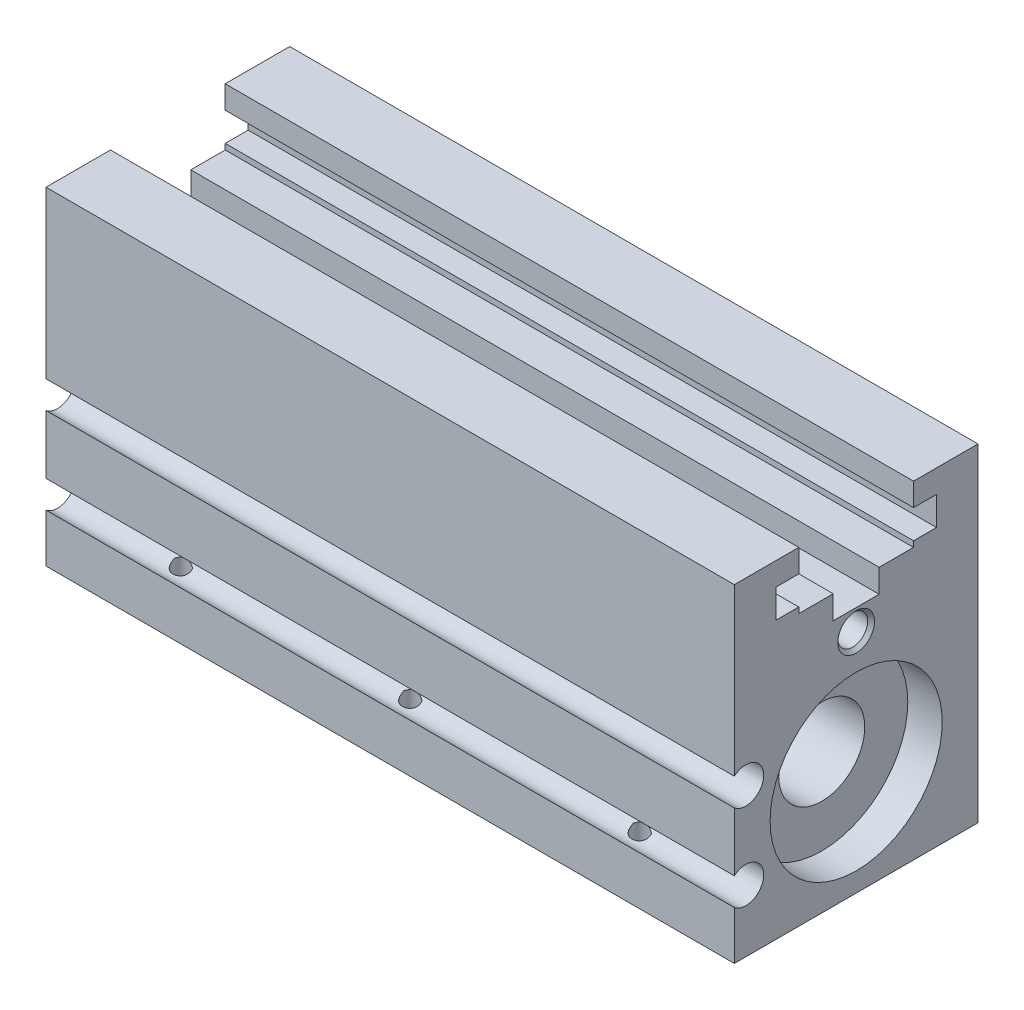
ISO-10303-21;
HEADER;
FILE_DESCRIPTION(('STEP AP214'),'2;1');
FILE_NAME('part.step','',(''),(''),'','','');
FILE_SCHEMA(('AUTOMOTIVE_DESIGN { 1 0 10303 214 1 1 1 1 }'));
ENDSEC;
DATA;
#1=APPLICATION_CONTEXT('core data for automotive mechanical design processes');
#2=APPLICATION_PROTOCOL_DEFINITION('international standard','automotive_design',2000,#1);
#3=PRODUCT_CONTEXT('',#1,'mechanical');
#4=PRODUCT('Part','Part','',(#3));
#5=PRODUCT_RELATED_PRODUCT_CATEGORY('part','',(#4));
#6=PRODUCT_DEFINITION_FORMATION('','',#4);
#7=PRODUCT_DEFINITION_CONTEXT('part definition',#1,'design');
#8=PRODUCT_DEFINITION('design','',#6,#7);
#9=PRODUCT_DEFINITION_SHAPE('','',#8);
#10=(LENGTH_UNIT() NAMED_UNIT(*) SI_UNIT(.MILLI.,.METRE.));
#11=(NAMED_UNIT(*) PLANE_ANGLE_UNIT() SI_UNIT($,.RADIAN.));
#12=(NAMED_UNIT(*) SI_UNIT($,.STERADIAN.) SOLID_ANGLE_UNIT());
#13=UNCERTAINTY_MEASURE_WITH_UNIT(LENGTH_MEASURE(1.E-05),#10,'distance_accuracy_value','');
#14=(GEOMETRIC_REPRESENTATION_CONTEXT(3) GLOBAL_UNCERTAINTY_ASSIGNED_CONTEXT((#13)) GLOBAL_UNIT_ASSIGNED_CONTEXT((#10,
#11,#12)) REPRESENTATION_CONTEXT('',''));
#15=CARTESIAN_POINT('',(0.,0.,0.));
#16=DIRECTION('',(0.,0.,1.));
#17=DIRECTION('',(1.,0.,0.));
#18=AXIS2_PLACEMENT_3D('',#15,#16,#17);
#19=CARTESIAN_POINT('',(76.2,-18.161,13.4874));
#20=DIRECTION('',(0.,1.,0.));
#21=DIRECTION('',(0.,0.,1.));
#22=AXIS2_PLACEMENT_3D('',#19,#20,#21);
#23=PLANE('',#22);
#24=CARTESIAN_POINT('',(38.1,-18.161,11.1125));
#25=DIRECTION('',(0.,-1.,0.));
#26=DIRECTION('',(0.,0.,-1.));
#27=AXIS2_PLACEMENT_3D('',#24,#25,#26);
#28=CIRCLE('',#27,1.397);
#29=CARTESIAN_POINT('',(38.1,-18.1610000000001,9.7155));
#30=VERTEX_POINT('',#29);
#31=EDGE_CURVE('E602',#30,#30,#28,.T.);
#32=ORIENTED_EDGE('',*,*,#31,.F.);
#33=EDGE_LOOP('',(#32));
#34=FACE_BOUND('',#33,.T.);
#35=CARTESIAN_POINT('',(57.15,-18.161,-11.1125));
#36=DIRECTION('',(0.,1.,0.));
#37=DIRECTION('',(0.,0.,1.));
#38=AXIS2_PLACEMENT_3D('',#35,#36,#37);
#39=CIRCLE('',#38,1.20269);
#40=CARTESIAN_POINT('',(57.15,-18.161,-9.90981));
#41=VERTEX_POINT('',#40);
#42=EDGE_CURVE('E633',#41,#41,#39,.T.);
#43=ORIENTED_EDGE('',*,*,#42,.T.);
#44=EDGE_LOOP('',(#43));
#45=FACE_BOUND('',#44,.T.);
#46=CARTESIAN_POINT('',(19.05,-18.161,11.1125));
#47=DIRECTION('',(0.,1.,0.));
#48=DIRECTION('',(0.,0.,1.));
#49=AXIS2_PLACEMENT_3D('',#46,#47,#48);
#50=CIRCLE('',#49,1.20269);
#51=CARTESIAN_POINT('',(19.05,-18.161,12.31519));
#52=VERTEX_POINT('',#51);
#53=EDGE_CURVE('E645',#52,#52,#50,.T.);
#54=ORIENTED_EDGE('',*,*,#53,.T.);
#55=EDGE_LOOP('',(#54));
#56=FACE_BOUND('',#55,.T.);
#57=CARTESIAN_POINT('',(63.5,-18.161,-11.1125));
#58=DIRECTION('',(0.,-1.,0.));
#59=DIRECTION('',(0.,0.,-1.));
#60=AXIS2_PLACEMENT_3D('',#57,#58,#59);
#61=CIRCLE('',#60,1.397);
#62=CARTESIAN_POINT('',(63.5,-18.1610000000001,-12.5095));
#63=VERTEX_POINT('',#62);
#64=EDGE_CURVE('E668',#63,#63,#61,.T.);
#65=ORIENTED_EDGE('',*,*,#64,.F.);
#66=EDGE_LOOP('',(#65));
#67=FACE_BOUND('',#66,.T.);
#68=CARTESIAN_POINT('',(12.7,-18.161,11.1125));
#69=DIRECTION('',(0.,-1.,0.));
#70=DIRECTION('',(0.,0.,-1.));
#71=AXIS2_PLACEMENT_3D('',#68,#69,#70);
#72=CIRCLE('',#71,1.397);
#73=CARTESIAN_POINT('',(12.7,-18.1610000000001,9.7155));
#74=VERTEX_POINT('',#73);
#75=EDGE_CURVE('E683',#74,#74,#72,.T.);
#76=ORIENTED_EDGE('',*,*,#75,.F.);
#77=EDGE_LOOP('',(#76));
#78=FACE_BOUND('',#77,.T.);
#79=DIRECTION('',(0.,0.,-1.));
#80=VECTOR('',#79,1.);
#81=CARTESIAN_POINT('',(0.,-18.161,13.4874));
#82=LINE('',#81,#80);
#83=CARTESIAN_POINT('',(0.,-18.161,13.4874));
#84=VERTEX_POINT('',#83);
#85=CARTESIAN_POINT('',(0.,-18.161,-13.4874));
#86=VERTEX_POINT('',#85);
#87=EDGE_CURVE('E799',#84,#86,#82,.T.);
#88=ORIENTED_EDGE('',*,*,#87,.T.);
#89=DIRECTION('',(-1.,0.,0.));
#90=VECTOR('',#89,1.);
#91=CARTESIAN_POINT('',(76.2,-18.161,-13.4874));
#92=LINE('',#91,#90);
#93=CARTESIAN_POINT('',(76.2,-18.161,-13.4874));
#94=VERTEX_POINT('',#93);
#95=EDGE_CURVE('E909',#94,#86,#92,.T.);
#96=ORIENTED_EDGE('',*,*,#95,.F.);
#97=DIRECTION('',(0.,0.,-1.));
#98=VECTOR('',#97,1.);
#99=CARTESIAN_POINT('',(76.2,-18.161,13.4874));
#100=LINE('',#99,#98);
#101=CARTESIAN_POINT('',(76.2,-18.161,13.4874));
#102=VERTEX_POINT('',#101);
#103=EDGE_CURVE('E749',#102,#94,#100,.T.);
#104=ORIENTED_EDGE('',*,*,#103,.F.);
#105=DIRECTION('',(-1.,0.,0.));
#106=VECTOR('',#105,1.);
#107=CARTESIAN_POINT('',(76.2,-18.161,13.4874));
#108=LINE('',#107,#106);
#109=EDGE_CURVE('E912',#102,#84,#108,.T.);
#110=ORIENTED_EDGE('',*,*,#109,.T.);
#111=EDGE_LOOP('',(#88,#96,#104,#110));
#112=FACE_BOUND('',#111,.T.);
#113=CARTESIAN_POINT('',(63.5,-18.161,11.1125));
#114=DIRECTION('',(0.,-1.,0.));
#115=DIRECTION('',(0.,0.,-1.));
#116=AXIS2_PLACEMENT_3D('',#113,#114,#115);
#117=CIRCLE('',#116,1.397);
#118=CARTESIAN_POINT('',(63.5,-18.1610000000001,9.7155));
#119=VERTEX_POINT('',#118);
#120=EDGE_CURVE('E675',#119,#119,#117,.T.);
#121=ORIENTED_EDGE('',*,*,#120,.F.);
#122=EDGE_LOOP('',(#121));
#123=FACE_BOUND('',#122,.T.);
#124=CARTESIAN_POINT('',(12.7,-18.161,-11.1125));
#125=DIRECTION('',(0.,-1.,0.));
#126=DIRECTION('',(0.,0.,-1.));
#127=AXIS2_PLACEMENT_3D('',#124,#125,#126);
#128=CIRCLE('',#127,1.397);
#129=CARTESIAN_POINT('',(12.7,-18.1610000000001,-12.5095));
#130=VERTEX_POINT('',#129);
#131=EDGE_CURVE('E659',#130,#130,#128,.T.);
#132=ORIENTED_EDGE('',*,*,#131,.F.);
#133=EDGE_LOOP('',(#132));
#134=FACE_BOUND('',#133,.T.);
#135=CARTESIAN_POINT('',(57.15,-18.161,11.1125));
#136=DIRECTION('',(0.,1.,0.));
#137=DIRECTION('',(0.,0.,1.));
#138=AXIS2_PLACEMENT_3D('',#135,#136,#137);
#139=CIRCLE('',#138,1.20269);
#140=CARTESIAN_POINT('',(57.15,-18.161,12.31519));
#141=VERTEX_POINT('',#140);
#142=EDGE_CURVE('E639',#141,#141,#139,.T.);
#143=ORIENTED_EDGE('',*,*,#142,.T.);
#144=EDGE_LOOP('',(#143));
#145=FACE_BOUND('',#144,.T.);
#146=CARTESIAN_POINT('',(19.05,-18.161,-11.1125));
#147=DIRECTION('',(0.,1.,0.));
#148=DIRECTION('',(0.,0.,1.));
#149=AXIS2_PLACEMENT_3D('',#146,#147,#148);
#150=CIRCLE('',#149,1.20269);
#151=CARTESIAN_POINT('',(19.05,-18.161,-9.90981));
#152=VERTEX_POINT('',#151);
#153=EDGE_CURVE('E629',#152,#152,#150,.T.);
#154=ORIENTED_EDGE('',*,*,#153,.T.);
#155=EDGE_LOOP('',(#154));
#156=FACE_BOUND('',#155,.T.);
#157=CARTESIAN_POINT('',(38.1,-18.161,-11.1125));
#158=DIRECTION('',(0.,-1.,0.));
#159=DIRECTION('',(0.,0.,-1.));
#160=AXIS2_PLACEMENT_3D('',#157,#158,#159);
#161=CIRCLE('',#160,1.397);
#162=CARTESIAN_POINT('',(38.1,-18.1610000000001,-12.5095));
#163=VERTEX_POINT('',#162);
#164=EDGE_CURVE('E934',#163,#163,#161,.T.);
#165=ORIENTED_EDGE('',*,*,#164,.F.);
#166=EDGE_LOOP('',(#165));
#167=FACE_BOUND('',#166,.T.);
#168=ADVANCED_FACE('F33',(#34,#45,#56,#67,#78,#112,#123,#134,#145,#156,#167),#23,.F.);
#169=CARTESIAN_POINT('',(76.2,-11.2776000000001,12.2174));
#170=DIRECTION('',(-1.,0.,0.));
#171=DIRECTION('',(0.,0.,1.));
#172=AXIS2_PLACEMENT_3D('',#169,#170,#171);
#173=CYLINDRICAL_SURFACE('',#172,1.98120000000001);
#174=CARTESIAN_POINT('',(62.4963841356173,-12.803987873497,10.9543507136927));
#175=CARTESIAN_POINT('',(62.4925312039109,-12.8242332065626,10.9788160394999));
#176=CARTESIAN_POINT('',(62.4895030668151,-12.8439491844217,11.0038430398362));
#177=CARTESIAN_POINT('',(62.4853061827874,-12.8822413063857,11.0549449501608));
#178=CARTESIAN_POINT('',(62.4841394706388,-12.9008161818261,11.0810209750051));
#179=CARTESIAN_POINT('',(62.4837557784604,-12.9548343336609,11.1609108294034));
#180=CARTESIAN_POINT('',(62.4877012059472,-12.9883519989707,11.216122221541));
#181=CARTESIAN_POINT('',(62.5056294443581,-13.0494752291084,11.3287249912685));
#182=CARTESIAN_POINT('',(62.5196819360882,-13.0770380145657,11.3861288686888));
#183=CARTESIAN_POINT('',(62.558822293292,-13.1253159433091,11.4998387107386));
#184=CARTESIAN_POINT('',(62.5838672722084,-13.1460571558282,11.5561480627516));
#185=CARTESIAN_POINT('',(62.6406038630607,-13.1785506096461,11.6570800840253));
#186=CARTESIAN_POINT('',(62.6708732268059,-13.1911549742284,11.7022349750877));
#187=CARTESIAN_POINT('',(62.7388687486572,-13.2121453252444,11.7877169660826));
#188=CARTESIAN_POINT('',(62.7766013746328,-13.2205276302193,11.8280398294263));
#189=CARTESIAN_POINT('',(62.8568054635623,-13.2336718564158,11.9007725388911));
#190=CARTESIAN_POINT('',(62.899029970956,-13.2385640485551,11.933432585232));
#191=CARTESIAN_POINT('',(62.9882009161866,-13.2461331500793,11.9917935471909));
#192=CARTESIAN_POINT('',(63.035146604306,-13.2488104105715,12.0174955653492));
#193=CARTESIAN_POINT('',(63.1343879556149,-13.252832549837,12.062054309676));
#194=CARTESIAN_POINT('',(63.1868189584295,-13.2541230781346,12.0806146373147));
#195=CARTESIAN_POINT('',(63.2940225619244,-13.2558805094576,12.1089459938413));
#196=CARTESIAN_POINT('',(63.3487956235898,-13.2563472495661,12.1187152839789));
#197=CARTESIAN_POINT('',(63.4605953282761,-13.2568490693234,12.129325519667));
#198=CARTESIAN_POINT('',(63.5176440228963,-13.2568730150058,12.1299361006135));
#199=CARTESIAN_POINT('',(63.6310428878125,-13.2564874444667,12.1216166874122));
#200=CARTESIAN_POINT('',(63.6873930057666,-13.2560778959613,12.1126859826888));
#201=CARTESIAN_POINT('',(63.7979988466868,-13.2544504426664,12.0854888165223));
#202=CARTESIAN_POINT('',(63.8522463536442,-13.2532296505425,12.0671890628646));
#203=CARTESIAN_POINT('',(63.9568633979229,-13.2492493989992,12.0217759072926));
#204=CARTESIAN_POINT('',(64.0072330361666,-13.2464899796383,11.9946627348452));
#205=CARTESIAN_POINT('',(64.1021329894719,-13.2384948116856,11.9327858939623));
#206=CARTESIAN_POINT('',(64.1467146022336,-13.233283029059,11.8980979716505));
#207=CARTESIAN_POINT('',(64.2292400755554,-13.2193561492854,11.8221520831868));
#208=CARTESIAN_POINT('',(64.2671860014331,-13.2106421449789,11.7808961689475));
#209=CARTESIAN_POINT('',(64.3341061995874,-13.1891950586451,11.6950599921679));
#210=CARTESIAN_POINT('',(64.3633572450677,-13.1766201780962,11.6506558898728));
#211=CARTESIAN_POINT('',(64.4140864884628,-13.1468483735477,11.5590866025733));
#212=CARTESIAN_POINT('',(64.4355693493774,-13.1296542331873,11.5119230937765));
#213=CARTESIAN_POINT('',(64.4703733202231,-13.0909069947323,11.4176387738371));
#214=CARTESIAN_POINT('',(64.4838477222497,-13.0694470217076,11.3705356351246));
#215=CARTESIAN_POINT('',(64.5037426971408,-13.0221609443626,11.2769668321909));
#216=CARTESIAN_POINT('',(64.510151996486,-12.996327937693,11.2305023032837));
#217=CARTESIAN_POINT('',(64.5163038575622,-12.9438716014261,11.144582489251));
#218=CARTESIAN_POINT('',(64.516705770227,-12.9176521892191,11.1049206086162));
#219=CARTESIAN_POINT('',(64.5132006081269,-12.8626568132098,11.0278616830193));
#220=CARTESIAN_POINT('',(64.5093124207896,-12.8338925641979,10.9904554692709));
#221=CARTESIAN_POINT('',(64.5036158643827,-12.803987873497,10.9543507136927));
#222=B_SPLINE_CURVE_WITH_KNOTS('',3,(#174,#175,#176,#177,#178,#179,#180,#181,#182,#183,#184,
#185,#186,#187,#188,#189,#190,#191,#192,#193,#194,#195,#196,#197,#198,#199,#200,#201,#202,#203,
#204,#205,#206,#207,#208,#209,#210,#211,#212,#213,#214,#215,#216,#217,#218,#219,#220,#221),
.UNSPECIFIED.,.F.,.F.,(4,2,2,2,2,2,2,2,2,2,2,2,2,2,2,2,2,2,2,2,2,2,2,4),(0.,0.095929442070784,
0.19196367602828,0.385059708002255,0.579499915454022,0.773188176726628,0.939748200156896,
1.10645320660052,1.26655395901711,1.42662932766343,1.59277234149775,1.75894820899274,
1.92929700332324,2.09965848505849,2.27062957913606,2.44159622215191,2.61092571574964,
2.78020241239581,2.94330429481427,3.10630810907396,3.26608196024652,3.42611038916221,
3.56842715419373,3.7101198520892),.UNSPECIFIED.);
#223=CARTESIAN_POINT('',(62.4963841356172,-12.803987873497,10.9543507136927));
#224=VERTEX_POINT('',#223);
#225=CARTESIAN_POINT('',(64.5036158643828,-12.803987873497,10.9543507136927));
#226=VERTEX_POINT('',#225);
#227=EDGE_CURVE('E366',#224,#226,#222,.T.);
#228=ORIENTED_EDGE('',*,*,#227,.F.);
#229=CARTESIAN_POINT('',(64.6148283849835,-12.8628466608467,11.0290623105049));
#230=CARTESIAN_POINT('',(64.590867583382,-12.8498036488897,11.0116648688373));
#231=CARTESIAN_POINT('',(64.5664779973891,-12.8367662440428,10.9948677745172));
#232=CARTESIAN_POINT('',(64.5169128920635,-12.810770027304,10.9624193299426));
#233=CARTESIAN_POINT('',(64.491737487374,-12.7978112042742,10.9467678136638));
#234=CARTESIAN_POINT('',(64.414978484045,-12.7590718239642,10.9013526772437));
#235=CARTESIAN_POINT('',(64.3623044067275,-12.7335061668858,10.8732305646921));
#236=CARTESIAN_POINT('',(64.2519697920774,-12.6825569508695,10.8200227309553));
#237=CARTESIAN_POINT('',(64.1941917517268,-12.6572314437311,10.7951262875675));
#238=CARTESIAN_POINT('',(64.0757941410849,-12.6092273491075,10.7500907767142));
#239=CARTESIAN_POINT('',(64.0151789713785,-12.586544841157,10.7299446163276));
#240=CARTESIAN_POINT('',(63.9241526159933,-12.5568711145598,10.7045302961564));
#241=CARTESIAN_POINT('',(63.8949655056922,-12.5479856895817,10.6970752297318));
#242=CARTESIAN_POINT('',(63.8358954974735,-12.5315829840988,10.683518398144));
#243=CARTESIAN_POINT('',(63.8060127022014,-12.5240655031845,10.6774164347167));
#244=CARTESIAN_POINT('',(63.7459420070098,-12.5108488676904,10.666812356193));
#245=CARTESIAN_POINT('',(63.7157619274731,-12.5051292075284,10.662292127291));
#246=CARTESIAN_POINT('',(63.6548796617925,-12.495769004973,10.6549488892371));
#247=CARTESIAN_POINT('',(63.6241776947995,-12.4921276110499,10.6521251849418));
#248=CARTESIAN_POINT('',(63.5619557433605,-12.4871845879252,10.648301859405));
#249=CARTESIAN_POINT('',(63.5304306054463,-12.4859223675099,10.647332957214));
#250=CARTESIAN_POINT('',(63.4673862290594,-12.4859814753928,10.647378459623));
#251=CARTESIAN_POINT('',(63.4358669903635,-12.4873026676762,10.6483927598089));
#252=CARTESIAN_POINT('',(63.3730040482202,-12.4924106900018,10.6523445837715));
#253=CARTESIAN_POINT('',(63.3416619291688,-12.4962094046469,10.6552913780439));
#254=CARTESIAN_POINT('',(63.2795269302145,-12.5059578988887,10.6629456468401));
#255=CARTESIAN_POINT('',(63.2487343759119,-12.5119089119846,10.6676541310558));
#256=CARTESIAN_POINT('',(63.1746914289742,-12.5284997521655,10.680988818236));
#257=CARTESIAN_POINT('',(63.1317950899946,-12.5400548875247,10.6904288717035));
#258=CARTESIAN_POINT('',(63.0474392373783,-12.5656520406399,10.7119581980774));
#259=CARTESIAN_POINT('',(63.00598070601,-12.5796957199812,10.7240492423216));
#260=CARTESIAN_POINT('',(62.9242841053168,-12.6095116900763,10.7505786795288));
#261=CARTESIAN_POINT('',(62.8840510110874,-12.6252900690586,10.7650254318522));
#262=CARTESIAN_POINT('',(62.8049096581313,-12.6579650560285,10.7960437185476));
#263=CARTESIAN_POINT('',(62.7660009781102,-12.6748613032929,10.8126145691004));
#264=CARTESIAN_POINT('',(62.6668771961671,-12.7195693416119,10.8582037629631));
#265=CARTESIAN_POINT('',(62.607626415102,-12.7479430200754,10.8888004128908));
#266=CARTESIAN_POINT('',(62.5217322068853,-12.7909280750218,10.9385464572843));
#267=CARTESIAN_POINT('',(62.4937451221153,-12.8052465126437,10.9556647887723));
#268=CARTESIAN_POINT('',(62.4387218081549,-12.8339894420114,10.9912975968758));
#269=CARTESIAN_POINT('',(62.4116857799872,-12.8484139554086,11.009812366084));
#270=CARTESIAN_POINT('',(62.3851716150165,-12.8628466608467,11.0290623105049));
#271=B_SPLINE_CURVE_WITH_KNOTS('',3,(#229,#230,#231,#232,#233,#234,#235,#236,#237,#238,#239,
#240,#241,#242,#243,#244,#245,#246,#247,#248,#249,#250,#251,#252,#253,#254,#255,#256,#257,#258,
#259,#260,#261,#262,#263,#264,#265,#266,#267,#268,#269,#270),.UNSPECIFIED.,.F.,.F.,(4,2,2,2,2,2,
2,2,2,2,2,2,2,2,2,2,2,2,2,2,4),(0.,0.0970467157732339,0.19407933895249,0.388717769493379,
0.591963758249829,0.794904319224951,0.889075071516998,0.983232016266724,1.07627239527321,
1.16927462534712,1.26380425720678,1.35832891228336,1.4533103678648,1.54834634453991,
1.6843652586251,1.82047533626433,1.95707936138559,2.09363951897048,2.31072018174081,
2.41807457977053,2.52545153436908),.UNSPECIFIED.);
#272=EDGE_CURVE('E360',#226,#224,#271,.T.);
#273=ORIENTED_EDGE('',*,*,#272,.F.);
#274=EDGE_LOOP('',(#228,#273));
#275=FACE_BOUND('',#274,.T.);
#276=CARTESIAN_POINT('',(0.,-11.2776000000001,12.2174));
#277=DIRECTION('',(-1.,0.,0.));
#278=DIRECTION('',(0.,0.,1.));
#279=AXIS2_PLACEMENT_3D('',#276,#277,#278);
#280=CIRCLE('',#279,1.98120000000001);
#281=CARTESIAN_POINT('',(0.,-9.7569904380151,13.4874));
#282=VERTEX_POINT('',#281);
#283=CARTESIAN_POINT('',(0.,-12.798209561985,13.4874));
#284=VERTEX_POINT('',#283);
#285=EDGE_CURVE('E750',#282,#284,#280,.T.);
#286=ORIENTED_EDGE('',*,*,#285,.T.);
#287=DIRECTION('',(-1.,0.,0.));
#288=VECTOR('',#287,1.);
#289=CARTESIAN_POINT('',(76.2,-12.798209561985,13.4874));
#290=LINE('',#289,#288);
#291=CARTESIAN_POINT('',(76.2,-12.798209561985,13.4874));
#292=VERTEX_POINT('',#291);
#293=EDGE_CURVE('E796',#292,#284,#290,.T.);
#294=ORIENTED_EDGE('',*,*,#293,.F.);
#295=CARTESIAN_POINT('',(76.2,-11.2776000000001,12.2174));
#296=DIRECTION('',(-1.,0.,0.));
#297=DIRECTION('',(0.,0.,1.));
#298=AXIS2_PLACEMENT_3D('',#295,#296,#297);
#299=CIRCLE('',#298,1.98120000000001);
#300=CARTESIAN_POINT('',(76.2,-9.7569904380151,13.4874));
#301=VERTEX_POINT('',#300);
#302=EDGE_CURVE('E794',#301,#292,#299,.T.);
#303=ORIENTED_EDGE('',*,*,#302,.F.);
#304=DIRECTION('',(-1.,0.,0.));
#305=VECTOR('',#304,1.);
#306=CARTESIAN_POINT('',(76.2,-9.7569904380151,13.4874));
#307=LINE('',#306,#305);
#308=EDGE_CURVE('E846',#301,#282,#307,.T.);
#309=ORIENTED_EDGE('',*,*,#308,.T.);
#310=EDGE_LOOP('',(#286,#294,#303,#309));
#311=FACE_BOUND('',#310,.T.);
#312=CARTESIAN_POINT('',(11.6963841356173,-12.803987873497,10.9543507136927));
#313=CARTESIAN_POINT('',(11.6925312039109,-12.8242332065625,10.9788160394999));
#314=CARTESIAN_POINT('',(11.6895030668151,-12.8439491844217,11.0038430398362));
#315=CARTESIAN_POINT('',(11.6853061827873,-12.8822413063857,11.0549449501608));
#316=CARTESIAN_POINT('',(11.6841394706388,-12.9008161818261,11.0810209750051));
#317=CARTESIAN_POINT('',(11.6837557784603,-12.9548343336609,11.1609108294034));
#318=CARTESIAN_POINT('',(11.6877012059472,-12.9883519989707,11.216122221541));
#319=CARTESIAN_POINT('',(11.7056294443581,-13.0494752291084,11.3287249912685));
#320=CARTESIAN_POINT('',(11.7196819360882,-13.0770380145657,11.3861288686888));
#321=CARTESIAN_POINT('',(11.758822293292,-13.1253159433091,11.4998387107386));
#322=CARTESIAN_POINT('',(11.7838672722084,-13.1460571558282,11.5561480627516));
#323=CARTESIAN_POINT('',(11.8406038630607,-13.1785506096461,11.6570800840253));
#324=CARTESIAN_POINT('',(11.8708732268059,-13.1911549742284,11.7022349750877));
#325=CARTESIAN_POINT('',(11.9388687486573,-13.2121453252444,11.7877169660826));
#326=CARTESIAN_POINT('',(11.9766013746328,-13.2205276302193,11.8280398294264));
#327=CARTESIAN_POINT('',(12.0568054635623,-13.2336718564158,11.9007725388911));
#328=CARTESIAN_POINT('',(12.099029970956,-13.2385640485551,11.933432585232));
#329=CARTESIAN_POINT('',(12.1882009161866,-13.2461331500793,11.9917935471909));
#330=CARTESIAN_POINT('',(12.2351466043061,-13.2488104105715,12.0174955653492));
#331=CARTESIAN_POINT('',(12.3343879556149,-13.252832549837,12.062054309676));
#332=CARTESIAN_POINT('',(12.3868189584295,-13.2541230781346,12.0806146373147));
#333=CARTESIAN_POINT('',(12.4940225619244,-13.2558805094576,12.1089459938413));
#334=CARTESIAN_POINT('',(12.5487956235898,-13.2563472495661,12.1187152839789));
#335=CARTESIAN_POINT('',(12.6605953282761,-13.2568490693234,12.129325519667));
#336=CARTESIAN_POINT('',(12.7176440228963,-13.2568730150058,12.1299361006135));
#337=CARTESIAN_POINT('',(12.8310428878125,-13.2564874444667,12.1216166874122));
#338=CARTESIAN_POINT('',(12.8873930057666,-13.2560778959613,12.1126859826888));
#339=CARTESIAN_POINT('',(12.9979988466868,-13.2544504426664,12.0854888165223));
#340=CARTESIAN_POINT('',(13.0522463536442,-13.2532296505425,12.0671890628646));
#341=CARTESIAN_POINT('',(13.156863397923,-13.2492493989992,12.0217759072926));
#342=CARTESIAN_POINT('',(13.2072330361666,-13.2464899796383,11.9946627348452));
#343=CARTESIAN_POINT('',(13.3021329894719,-13.2384948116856,11.9327858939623));
#344=CARTESIAN_POINT('',(13.3467146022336,-13.233283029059,11.8980979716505));
#345=CARTESIAN_POINT('',(13.4292400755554,-13.2193561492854,11.8221520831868));
#346=CARTESIAN_POINT('',(13.4671860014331,-13.2106421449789,11.7808961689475));
#347=CARTESIAN_POINT('',(13.5341061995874,-13.1891950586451,11.6950599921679));
#348=CARTESIAN_POINT('',(13.5633572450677,-13.1766201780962,11.6506558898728));
#349=CARTESIAN_POINT('',(13.6140864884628,-13.1468483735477,11.5590866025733));
#350=CARTESIAN_POINT('',(13.6355693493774,-13.1296542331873,11.5119230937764));
#351=CARTESIAN_POINT('',(13.6703733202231,-13.0909069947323,11.4176387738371));
#352=CARTESIAN_POINT('',(13.6838477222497,-13.0694470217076,11.3705356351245));
#353=CARTESIAN_POINT('',(13.7037426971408,-13.0221609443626,11.2769668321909));
#354=CARTESIAN_POINT('',(13.710151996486,-12.996327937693,11.2305023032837));
#355=CARTESIAN_POINT('',(13.7163038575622,-12.9438716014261,11.1445824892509));
#356=CARTESIAN_POINT('',(13.716705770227,-12.9176521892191,11.1049206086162));
#357=CARTESIAN_POINT('',(13.7132006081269,-12.8626568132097,11.0278616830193));
#358=CARTESIAN_POINT('',(13.7093124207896,-12.8338925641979,10.9904554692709));
#359=CARTESIAN_POINT('',(13.7036158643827,-12.803987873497,10.9543507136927));
#360=B_SPLINE_CURVE_WITH_KNOTS('',3,(#312,#313,#314,#315,#316,#317,#318,#319,#320,#321,#322,
#323,#324,#325,#326,#327,#328,#329,#330,#331,#332,#333,#334,#335,#336,#337,#338,#339,#340,#341,
#342,#343,#344,#345,#346,#347,#348,#349,#350,#351,#352,#353,#354,#355,#356,#357,#358,#359),
.UNSPECIFIED.,.F.,.F.,(4,2,2,2,2,2,2,2,2,2,2,2,2,2,2,2,2,2,2,2,2,2,2,4),(0.,0.0959294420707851,
0.191963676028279,0.385059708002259,0.579499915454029,0.773188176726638,0.93974820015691,
1.10645320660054,1.26655395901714,1.42662932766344,1.59277234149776,1.75894820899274,
1.92929700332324,2.0996584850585,2.27062957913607,2.44159622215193,2.61092571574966,
2.78020241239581,2.94330429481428,3.10630810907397,3.26608196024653,3.42611038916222,
3.56842715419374,3.7101198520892),.UNSPECIFIED.);
#361=CARTESIAN_POINT('',(11.6963841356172,-12.803987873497,10.9543507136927));
#362=VERTEX_POINT('',#361);
#363=CARTESIAN_POINT('',(13.7036158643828,-12.803987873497,10.9543507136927));
#364=VERTEX_POINT('',#363);
#365=EDGE_CURVE('E353',#362,#364,#360,.T.);
#366=ORIENTED_EDGE('',*,*,#365,.F.);
#367=CARTESIAN_POINT('',(13.8148283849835,-12.8628466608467,11.0290623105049));
#368=CARTESIAN_POINT('',(13.790867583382,-12.8498036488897,11.0116648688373));
#369=CARTESIAN_POINT('',(13.7664779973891,-12.8367662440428,10.9948677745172));
#370=CARTESIAN_POINT('',(13.7169128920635,-12.810770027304,10.9624193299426));
#371=CARTESIAN_POINT('',(13.691737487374,-12.7978112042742,10.9467678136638));
#372=CARTESIAN_POINT('',(13.614978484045,-12.7590718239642,10.9013526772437));
#373=CARTESIAN_POINT('',(13.5623044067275,-12.7335061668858,10.8732305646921));
#374=CARTESIAN_POINT('',(13.4519697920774,-12.6825569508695,10.8200227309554));
#375=CARTESIAN_POINT('',(13.3941917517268,-12.6572314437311,10.7951262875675));
#376=CARTESIAN_POINT('',(13.275794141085,-12.6092273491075,10.7500907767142));
#377=CARTESIAN_POINT('',(13.2151789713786,-12.5865448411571,10.7299446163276));
#378=CARTESIAN_POINT('',(13.1241526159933,-12.5568711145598,10.7045302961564));
#379=CARTESIAN_POINT('',(13.0949655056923,-12.5479856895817,10.6970752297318));
#380=CARTESIAN_POINT('',(13.0358954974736,-12.5315829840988,10.683518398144));
#381=CARTESIAN_POINT('',(13.0060127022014,-12.5240655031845,10.6774164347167));
#382=CARTESIAN_POINT('',(12.9459420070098,-12.5108488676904,10.666812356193));
#383=CARTESIAN_POINT('',(12.9157619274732,-12.5051292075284,10.662292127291));
#384=CARTESIAN_POINT('',(12.8548796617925,-12.495769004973,10.6549488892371));
#385=CARTESIAN_POINT('',(12.8241776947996,-12.4921276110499,10.6521251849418));
#386=CARTESIAN_POINT('',(12.7619557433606,-12.4871845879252,10.648301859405));
#387=CARTESIAN_POINT('',(12.7304306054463,-12.4859223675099,10.647332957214));
#388=CARTESIAN_POINT('',(12.6673862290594,-12.4859814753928,10.647378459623));
#389=CARTESIAN_POINT('',(12.6358669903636,-12.4873026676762,10.6483927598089));
#390=CARTESIAN_POINT('',(12.5730040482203,-12.4924106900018,10.6523445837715));
#391=CARTESIAN_POINT('',(12.5416619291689,-12.4962094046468,10.6552913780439));
#392=CARTESIAN_POINT('',(12.4795269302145,-12.5059578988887,10.6629456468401));
#393=CARTESIAN_POINT('',(12.4487343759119,-12.5119089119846,10.6676541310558));
#394=CARTESIAN_POINT('',(12.3746914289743,-12.5284997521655,10.680988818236));
#395=CARTESIAN_POINT('',(12.3317950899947,-12.5400548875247,10.6904288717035));
#396=CARTESIAN_POINT('',(12.2474392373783,-12.5656520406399,10.7119581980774));
#397=CARTESIAN_POINT('',(12.20598070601,-12.5796957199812,10.7240492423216));
#398=CARTESIAN_POINT('',(12.1242841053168,-12.6095116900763,10.7505786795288));
#399=CARTESIAN_POINT('',(12.0840510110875,-12.6252900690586,10.7650254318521));
#400=CARTESIAN_POINT('',(12.0049096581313,-12.6579650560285,10.7960437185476));
#401=CARTESIAN_POINT('',(11.9660009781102,-12.6748613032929,10.8126145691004));
#402=CARTESIAN_POINT('',(11.8668771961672,-12.7195693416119,10.8582037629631));
#403=CARTESIAN_POINT('',(11.807626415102,-12.7479430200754,10.8888004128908));
#404=CARTESIAN_POINT('',(11.7217322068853,-12.7909280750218,10.9385464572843));
#405=CARTESIAN_POINT('',(11.6937451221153,-12.8052465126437,10.9556647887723));
#406=CARTESIAN_POINT('',(11.6387218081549,-12.8339894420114,10.9912975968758));
#407=CARTESIAN_POINT('',(11.6116857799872,-12.8484139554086,11.009812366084));
#408=CARTESIAN_POINT('',(11.5851716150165,-12.8628466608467,11.0290623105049));
#409=B_SPLINE_CURVE_WITH_KNOTS('',3,(#367,#368,#369,#370,#371,#372,#373,#374,#375,#376,#377,
#378,#379,#380,#381,#382,#383,#384,#385,#386,#387,#388,#389,#390,#391,#392,#393,#394,#395,#396,
#397,#398,#399,#400,#401,#402,#403,#404,#405,#406,#407,#408),.UNSPECIFIED.,.F.,.F.,(4,2,2,2,2,2,
2,2,2,2,2,2,2,2,2,2,2,2,2,2,4),(0.,0.0970467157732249,0.194079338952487,0.388717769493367,
0.591963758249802,0.794904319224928,0.889075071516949,0.983232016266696,1.07627239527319,
1.16927462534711,1.26380425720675,1.35832891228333,1.45331036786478,1.5483463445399,
1.68436525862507,1.82047533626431,1.95707936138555,2.09363951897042,2.31072018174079,
2.41807457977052,2.52545153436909),.UNSPECIFIED.);
#410=EDGE_CURVE('E344',#364,#362,#409,.T.);
#411=ORIENTED_EDGE('',*,*,#410,.F.);
#412=EDGE_LOOP('',(#366,#411));
#413=FACE_BOUND('',#412,.T.);
#414=CARTESIAN_POINT('',(37.0963841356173,-12.803987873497,10.9543507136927));
#415=CARTESIAN_POINT('',(37.0925312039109,-12.8242332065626,10.9788160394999));
#416=CARTESIAN_POINT('',(37.0895030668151,-12.8439491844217,11.0038430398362));
#417=CARTESIAN_POINT('',(37.0853061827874,-12.8822413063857,11.0549449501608));
#418=CARTESIAN_POINT('',(37.0841394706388,-12.9008161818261,11.0810209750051));
#419=CARTESIAN_POINT('',(37.0837557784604,-12.9548343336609,11.1609108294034));
#420=CARTESIAN_POINT('',(37.0877012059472,-12.9883519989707,11.216122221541));
#421=CARTESIAN_POINT('',(37.1056294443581,-13.0494752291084,11.3287249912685));
#422=CARTESIAN_POINT('',(37.1196819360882,-13.0770380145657,11.3861288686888));
#423=CARTESIAN_POINT('',(37.158822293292,-13.1253159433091,11.4998387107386));
#424=CARTESIAN_POINT('',(37.1838672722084,-13.1460571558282,11.5561480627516));
#425=CARTESIAN_POINT('',(37.2406038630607,-13.1785506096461,11.6570800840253));
#426=CARTESIAN_POINT('',(37.2708732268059,-13.1911549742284,11.7022349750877));
#427=CARTESIAN_POINT('',(37.3388687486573,-13.2121453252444,11.7877169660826));
#428=CARTESIAN_POINT('',(37.3766013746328,-13.2205276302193,11.8280398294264));
#429=CARTESIAN_POINT('',(37.4568054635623,-13.2336718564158,11.9007725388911));
#430=CARTESIAN_POINT('',(37.499029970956,-13.2385640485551,11.933432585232));
#431=CARTESIAN_POINT('',(37.5882009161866,-13.2461331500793,11.9917935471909));
#432=CARTESIAN_POINT('',(37.6351466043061,-13.2488104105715,12.0174955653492));
#433=CARTESIAN_POINT('',(37.7343879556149,-13.252832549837,12.062054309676));
#434=CARTESIAN_POINT('',(37.7868189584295,-13.2541230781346,12.0806146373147));
#435=CARTESIAN_POINT('',(37.8940225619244,-13.2558805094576,12.1089459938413));
#436=CARTESIAN_POINT('',(37.9487956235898,-13.2563472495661,12.1187152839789));
#437=CARTESIAN_POINT('',(38.0605953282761,-13.2568490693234,12.129325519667));
#438=CARTESIAN_POINT('',(38.1176440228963,-13.2568730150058,12.1299361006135));
#439=CARTESIAN_POINT('',(38.2310428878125,-13.2564874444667,12.1216166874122));
#440=CARTESIAN_POINT('',(38.2873930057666,-13.2560778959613,12.1126859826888));
#441=CARTESIAN_POINT('',(38.3979988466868,-13.2544504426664,12.0854888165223));
#442=CARTESIAN_POINT('',(38.4522463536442,-13.2532296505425,12.0671890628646));
#443=CARTESIAN_POINT('',(38.5568633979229,-13.2492493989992,12.0217759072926));
#444=CARTESIAN_POINT('',(38.6072330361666,-13.2464899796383,11.9946627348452));
#445=CARTESIAN_POINT('',(38.7021329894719,-13.2384948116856,11.9327858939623));
#446=CARTESIAN_POINT('',(38.7467146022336,-13.233283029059,11.8980979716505));
#447=CARTESIAN_POINT('',(38.8292400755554,-13.2193561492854,11.8221520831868));
#448=CARTESIAN_POINT('',(38.8671860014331,-13.2106421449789,11.7808961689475));
#449=CARTESIAN_POINT('',(38.9341061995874,-13.1891950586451,11.6950599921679));
#450=CARTESIAN_POINT('',(38.9633572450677,-13.1766201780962,11.6506558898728));
#451=CARTESIAN_POINT('',(39.0140864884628,-13.1468483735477,11.5590866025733));
#452=CARTESIAN_POINT('',(39.0355693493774,-13.1296542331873,11.5119230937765));
#453=CARTESIAN_POINT('',(39.0703733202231,-13.0909069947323,11.4176387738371));
#454=CARTESIAN_POINT('',(39.0838477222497,-13.0694470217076,11.3705356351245));
#455=CARTESIAN_POINT('',(39.1037426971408,-13.0221609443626,11.2769668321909));
#456=CARTESIAN_POINT('',(39.110151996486,-12.996327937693,11.2305023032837));
#457=CARTESIAN_POINT('',(39.1163038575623,-12.9438716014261,11.144582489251));
#458=CARTESIAN_POINT('',(39.116705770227,-12.9176521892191,11.1049206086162));
#459=CARTESIAN_POINT('',(39.1132006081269,-12.8626568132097,11.0278616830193));
#460=CARTESIAN_POINT('',(39.1093124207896,-12.8338925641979,10.9904554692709));
#461=CARTESIAN_POINT('',(39.1036158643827,-12.803987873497,10.9543507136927));
#462=B_SPLINE_CURVE_WITH_KNOTS('',3,(#414,#415,#416,#417,#418,#419,#420,#421,#422,#423,#424,
#425,#426,#427,#428,#429,#430,#431,#432,#433,#434,#435,#436,#437,#438,#439,#440,#441,#442,#443,
#444,#445,#446,#447,#448,#449,#450,#451,#452,#453,#454,#455,#456,#457,#458,#459,#460,#461),
.UNSPECIFIED.,.F.,.F.,(4,2,2,2,2,2,2,2,2,2,2,2,2,2,2,2,2,2,2,2,2,2,2,4),(0.,0.095929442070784,
0.191963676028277,0.385059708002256,0.579499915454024,0.773188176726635,0.939748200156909,
1.10645320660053,1.26655395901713,1.42662932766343,1.59277234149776,1.75894820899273,
1.92929700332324,2.09965848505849,2.27062957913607,2.44159622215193,2.61092571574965,
2.7802024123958,2.94330429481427,3.10630810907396,3.26608196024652,3.42611038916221,
3.56842715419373,3.7101198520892),.UNSPECIFIED.);
#463=CARTESIAN_POINT('',(37.0963841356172,-12.803987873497,10.9543507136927));
#464=VERTEX_POINT('',#463);
#465=CARTESIAN_POINT('',(39.1036158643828,-12.803987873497,10.9543507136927));
#466=VERTEX_POINT('',#465);
#467=EDGE_CURVE('E11',#464,#466,#462,.T.);
#468=ORIENTED_EDGE('',*,*,#467,.F.);
#469=CARTESIAN_POINT('',(39.2148283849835,-12.8628466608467,11.0290623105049));
#470=CARTESIAN_POINT('',(39.190867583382,-12.8498036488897,11.0116648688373));
#471=CARTESIAN_POINT('',(39.1664779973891,-12.8367662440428,10.9948677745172));
#472=CARTESIAN_POINT('',(39.1169128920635,-12.810770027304,10.9624193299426));
#473=CARTESIAN_POINT('',(39.0917374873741,-12.7978112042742,10.9467678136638));
#474=CARTESIAN_POINT('',(39.014978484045,-12.7590718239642,10.9013526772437));
#475=CARTESIAN_POINT('',(38.9623044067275,-12.7335061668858,10.8732305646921));
#476=CARTESIAN_POINT('',(38.8519697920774,-12.6825569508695,10.8200227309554));
#477=CARTESIAN_POINT('',(38.7941917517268,-12.6572314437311,10.7951262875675));
#478=CARTESIAN_POINT('',(38.6757941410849,-12.6092273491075,10.7500907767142));
#479=CARTESIAN_POINT('',(38.6151789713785,-12.586544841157,10.7299446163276));
#480=CARTESIAN_POINT('',(38.5241526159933,-12.5568711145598,10.7045302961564));
#481=CARTESIAN_POINT('',(38.4949655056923,-12.5479856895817,10.6970752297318));
#482=CARTESIAN_POINT('',(38.4358954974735,-12.5315829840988,10.683518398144));
#483=CARTESIAN_POINT('',(38.4060127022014,-12.5240655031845,10.6774164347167));
#484=CARTESIAN_POINT('',(38.3459420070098,-12.5108488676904,10.666812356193));
#485=CARTESIAN_POINT('',(38.3157619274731,-12.5051292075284,10.662292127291));
#486=CARTESIAN_POINT('',(38.2548796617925,-12.495769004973,10.6549488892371));
#487=CARTESIAN_POINT('',(38.2241776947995,-12.4921276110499,10.6521251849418));
#488=CARTESIAN_POINT('',(38.1619557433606,-12.4871845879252,10.648301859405));
#489=CARTESIAN_POINT('',(38.1304306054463,-12.4859223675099,10.647332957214));
#490=CARTESIAN_POINT('',(38.0673862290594,-12.4859814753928,10.647378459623));
#491=CARTESIAN_POINT('',(38.0358669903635,-12.4873026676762,10.6483927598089));
#492=CARTESIAN_POINT('',(37.9730040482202,-12.4924106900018,10.6523445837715));
#493=CARTESIAN_POINT('',(37.9416619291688,-12.4962094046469,10.6552913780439));
#494=CARTESIAN_POINT('',(37.8795269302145,-12.5059578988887,10.6629456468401));
#495=CARTESIAN_POINT('',(37.8487343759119,-12.5119089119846,10.6676541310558));
#496=CARTESIAN_POINT('',(37.7746914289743,-12.5284997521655,10.680988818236));
#497=CARTESIAN_POINT('',(37.7317950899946,-12.5400548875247,10.6904288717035));
#498=CARTESIAN_POINT('',(37.6474392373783,-12.5656520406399,10.7119581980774));
#499=CARTESIAN_POINT('',(37.60598070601,-12.5796957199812,10.7240492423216));
#500=CARTESIAN_POINT('',(37.5242841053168,-12.6095116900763,10.7505786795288));
#501=CARTESIAN_POINT('',(37.4840510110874,-12.6252900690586,10.7650254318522));
#502=CARTESIAN_POINT('',(37.4049096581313,-12.6579650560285,10.7960437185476));
#503=CARTESIAN_POINT('',(37.3660009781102,-12.6748613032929,10.8126145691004));
#504=CARTESIAN_POINT('',(37.2668771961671,-12.7195693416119,10.8582037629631));
#505=CARTESIAN_POINT('',(37.207626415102,-12.7479430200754,10.8888004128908));
#506=CARTESIAN_POINT('',(37.1217322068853,-12.7909280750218,10.9385464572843));
#507=CARTESIAN_POINT('',(37.0937451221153,-12.8052465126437,10.9556647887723));
#508=CARTESIAN_POINT('',(37.0387218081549,-12.8339894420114,10.9912975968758));
#509=CARTESIAN_POINT('',(37.0116857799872,-12.8484139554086,11.009812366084));
#510=CARTESIAN_POINT('',(36.9851716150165,-12.8628466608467,11.0290623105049));
#511=B_SPLINE_CURVE_WITH_KNOTS('',3,(#469,#470,#471,#472,#473,#474,#475,#476,#477,#478,#479,
#480,#481,#482,#483,#484,#485,#486,#487,#488,#489,#490,#491,#492,#493,#494,#495,#496,#497,#498,
#499,#500,#501,#502,#503,#504,#505,#506,#507,#508,#509,#510),.UNSPECIFIED.,.F.,.F.,(4,2,2,2,2,2,
2,2,2,2,2,2,2,2,2,2,2,2,2,2,4),(0.,0.0970467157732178,0.194079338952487,0.388717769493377,
0.59196375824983,0.794904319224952,0.889075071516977,0.983232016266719,1.07627239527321,
1.16927462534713,1.26380425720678,1.35832891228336,1.45331036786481,1.54834634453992,
1.68436525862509,1.82047533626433,1.95707936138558,2.09363951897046,2.31072018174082,
2.41807457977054,2.52545153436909),.UNSPECIFIED.);
#512=EDGE_CURVE('E46',#466,#464,#511,.T.);
#513=ORIENTED_EDGE('',*,*,#512,.F.);
#514=EDGE_LOOP('',(#468,#513));
#515=FACE_BOUND('',#514,.T.);
#516=ADVANCED_FACE('F242',(#275,#311,#413,#515),#173,.F.);
#517=CARTESIAN_POINT('',(76.2,-1.72719999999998,12.2174));
#518=DIRECTION('',(-1.,0.,0.));
#519=DIRECTION('',(0.,0.,1.));
#520=AXIS2_PLACEMENT_3D('',#517,#518,#519);
#521=PLANE('',#520);
#522=DIRECTION('',(0.,-1.,0.));
#523=VECTOR('',#522,1.);
#524=CARTESIAN_POINT('',(76.2,-12.798209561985,13.4874));
#525=LINE('',#524,#523);
#526=EDGE_CURVE('E591',#292,#102,#525,.T.);
#527=ORIENTED_EDGE('',*,*,#526,.T.);
#528=ORIENTED_EDGE('',*,*,#103,.T.);
#529=DIRECTION('',(0.,1.,0.));
#530=VECTOR('',#529,1.);
#531=CARTESIAN_POINT('',(76.2,-18.161,-13.4874));
#532=LINE('',#531,#530);
#533=CARTESIAN_POINT('',(76.2,18.161,-13.4874));
#534=VERTEX_POINT('',#533);
#535=EDGE_CURVE('E752',#94,#534,#532,.T.);
#536=ORIENTED_EDGE('',*,*,#535,.T.);
#537=DIRECTION('',(0.,0.,1.));
#538=VECTOR('',#537,1.);
#539=CARTESIAN_POINT('',(76.2,18.161,-13.4874));
#540=LINE('',#539,#538);
#541=CARTESIAN_POINT('',(76.2,18.161,-6.35));
#542=VERTEX_POINT('',#541);
#543=EDGE_CURVE('E754',#534,#542,#540,.T.);
#544=ORIENTED_EDGE('',*,*,#543,.T.);
#545=DIRECTION('',(0.,-1.,0.));
#546=VECTOR('',#545,1.);
#547=CARTESIAN_POINT('',(76.2,18.161,-6.35));
#548=LINE('',#547,#546);
#549=CARTESIAN_POINT('',(76.2,15.621,-6.35));
#550=VERTEX_POINT('',#549);
#551=EDGE_CURVE('E756',#542,#550,#548,.T.);
#552=ORIENTED_EDGE('',*,*,#551,.T.);
#553=DIRECTION('',(0.,0.,-1.));
#554=VECTOR('',#553,1.);
#555=CARTESIAN_POINT('',(76.2,15.621,-6.35));
#556=LINE('',#555,#554);
#557=CARTESIAN_POINT('',(76.2,15.621,-8.89));
#558=VERTEX_POINT('',#557);
#559=EDGE_CURVE('E758',#550,#558,#556,.T.);
#560=ORIENTED_EDGE('',*,*,#559,.T.);
#561=DIRECTION('',(0.,-1.,0.));
#562=VECTOR('',#561,1.);
#563=CARTESIAN_POINT('',(76.2,15.621,-8.89));
#564=LINE('',#563,#562);
#565=CARTESIAN_POINT('',(76.2,12.446,-8.89));
#566=VERTEX_POINT('',#565);
#567=EDGE_CURVE('E760',#558,#566,#564,.T.);
#568=ORIENTED_EDGE('',*,*,#567,.T.);
#569=DIRECTION('',(0.,0.,1.));
#570=VECTOR('',#569,1.);
#571=CARTESIAN_POINT('',(76.2,12.446,-8.89));
#572=LINE('',#571,#570);
#573=CARTESIAN_POINT('',(76.2,12.446,-6.35));
#574=VERTEX_POINT('',#573);
#575=EDGE_CURVE('E762',#566,#574,#572,.T.);
#576=ORIENTED_EDGE('',*,*,#575,.T.);
#577=DIRECTION('',(0.,-1.,0.));
#578=VECTOR('',#577,1.);
#579=CARTESIAN_POINT('',(76.2,12.446,-6.35));
#580=LINE('',#579,#578);
#581=CARTESIAN_POINT('',(76.2,11.811,-6.35));
#582=VERTEX_POINT('',#581);
#583=EDGE_CURVE('E764',#574,#582,#580,.T.);
#584=ORIENTED_EDGE('',*,*,#583,.T.);
#585=DIRECTION('',(0.,0.,1.));
#586=VECTOR('',#585,1.);
#587=CARTESIAN_POINT('',(76.2,11.811,-6.35));
#588=LINE('',#587,#586);
#589=CARTESIAN_POINT('',(76.2,11.811,-2.54));
#590=VERTEX_POINT('',#589);
#591=EDGE_CURVE('E766',#582,#590,#588,.T.);
#592=ORIENTED_EDGE('',*,*,#591,.T.);
#593=DIRECTION('',(0.,-1.,0.));
#594=VECTOR('',#593,1.);
#595=CARTESIAN_POINT('',(76.2,11.811,-2.54));
#596=LINE('',#595,#594);
#597=CARTESIAN_POINT('',(76.2,9.2202,-2.54));
#598=VERTEX_POINT('',#597);
#599=EDGE_CURVE('E768',#590,#598,#596,.T.);
#600=ORIENTED_EDGE('',*,*,#599,.T.);
#601=DIRECTION('',(0.,0.,1.));
#602=VECTOR('',#601,1.);
#603=CARTESIAN_POINT('',(76.2,9.2202,-2.54));
#604=LINE('',#603,#602);
#605=CARTESIAN_POINT('',(76.2,9.2202,2.54));
#606=VERTEX_POINT('',#605);
#607=EDGE_CURVE('E770',#598,#606,#604,.T.);
#608=ORIENTED_EDGE('',*,*,#607,.T.);
#609=DIRECTION('',(0.,1.,0.));
#610=VECTOR('',#609,1.);
#611=CARTESIAN_POINT('',(76.2,9.2202,2.54));
#612=LINE('',#611,#610);
#613=CARTESIAN_POINT('',(76.2,11.811,2.54));
#614=VERTEX_POINT('',#613);
#615=EDGE_CURVE('E772',#606,#614,#612,.T.);
#616=ORIENTED_EDGE('',*,*,#615,.T.);
#617=DIRECTION('',(0.,0.,1.));
#618=VECTOR('',#617,1.);
#619=CARTESIAN_POINT('',(76.2,11.811,2.54));
#620=LINE('',#619,#618);
#621=CARTESIAN_POINT('',(76.2,11.811,6.35));
#622=VERTEX_POINT('',#621);
#623=EDGE_CURVE('E774',#614,#622,#620,.T.);
#624=ORIENTED_EDGE('',*,*,#623,.T.);
#625=DIRECTION('',(0.,1.,0.));
#626=VECTOR('',#625,1.);
#627=CARTESIAN_POINT('',(76.2,11.811,6.35));
#628=LINE('',#627,#626);
#629=CARTESIAN_POINT('',(76.2,12.446,6.35));
#630=VERTEX_POINT('',#629);
#631=EDGE_CURVE('E776',#622,#630,#628,.T.);
#632=ORIENTED_EDGE('',*,*,#631,.T.);
#633=DIRECTION('',(0.,0.,1.));
#634=VECTOR('',#633,1.);
#635=CARTESIAN_POINT('',(76.2,12.446,6.35));
#636=LINE('',#635,#634);
#637=CARTESIAN_POINT('',(76.2,12.446,8.89));
#638=VERTEX_POINT('',#637);
#639=EDGE_CURVE('E778',#630,#638,#636,.T.);
#640=ORIENTED_EDGE('',*,*,#639,.T.);
#641=DIRECTION('',(0.,1.,0.));
#642=VECTOR('',#641,1.);
#643=CARTESIAN_POINT('',(76.2,12.446,8.89));
#644=LINE('',#643,#642);
#645=CARTESIAN_POINT('',(76.2,15.621,8.89));
#646=VERTEX_POINT('',#645);
#647=EDGE_CURVE('E780',#638,#646,#644,.T.);
#648=ORIENTED_EDGE('',*,*,#647,.T.);
#649=DIRECTION('',(0.,0.,-1.));
#650=VECTOR('',#649,1.);
#651=CARTESIAN_POINT('',(76.2,15.621,8.89));
#652=LINE('',#651,#650);
#653=CARTESIAN_POINT('',(76.2,15.621,6.35));
#654=VERTEX_POINT('',#653);
#655=EDGE_CURVE('E782',#646,#654,#652,.T.);
#656=ORIENTED_EDGE('',*,*,#655,.T.);
#657=DIRECTION('',(0.,1.,0.));
#658=VECTOR('',#657,1.);
#659=CARTESIAN_POINT('',(76.2,15.621,6.35));
#660=LINE('',#659,#658);
#661=CARTESIAN_POINT('',(76.2,18.161,6.35));
#662=VERTEX_POINT('',#661);
#663=EDGE_CURVE('E784',#654,#662,#660,.T.);
#664=ORIENTED_EDGE('',*,*,#663,.T.);
#665=DIRECTION('',(0.,0.,1.));
#666=VECTOR('',#665,1.);
#667=CARTESIAN_POINT('',(76.2,18.161,6.35));
#668=LINE('',#667,#666);
#669=CARTESIAN_POINT('',(76.2,18.161,13.4874));
#670=VERTEX_POINT('',#669);
#671=EDGE_CURVE('E786',#662,#670,#668,.T.);
#672=ORIENTED_EDGE('',*,*,#671,.T.);
#673=DIRECTION('',(0.,-1.,0.));
#674=VECTOR('',#673,1.);
#675=CARTESIAN_POINT('',(76.2,18.161,13.4874));
#676=LINE('',#675,#674);
#677=CARTESIAN_POINT('',(76.2,-0.20659043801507,13.4874));
#678=VERTEX_POINT('',#677);
#679=EDGE_CURVE('E788',#670,#678,#676,.T.);
#680=ORIENTED_EDGE('',*,*,#679,.T.);
#681=CARTESIAN_POINT('',(76.2,-1.72719999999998,12.2174));
#682=DIRECTION('',(-1.,0.,0.));
#683=DIRECTION('',(0.,0.,1.));
#684=AXIS2_PLACEMENT_3D('',#681,#682,#683);
#685=CIRCLE('',#684,1.98119999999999);
#686=CARTESIAN_POINT('',(76.2,-3.2478095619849,13.4874));
#687=VERTEX_POINT('',#686);
#688=EDGE_CURVE('E790',#678,#687,#685,.T.);
#689=ORIENTED_EDGE('',*,*,#688,.T.);
#690=DIRECTION('',(0.,-1.,0.));
#691=VECTOR('',#690,1.);
#692=CARTESIAN_POINT('',(76.2,-3.2478095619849,13.4874));
#693=LINE('',#692,#691);
#694=EDGE_CURVE('E792',#687,#301,#693,.T.);
#695=ORIENTED_EDGE('',*,*,#694,.T.);
#696=ORIENTED_EDGE('',*,*,#302,.T.);
#697=EDGE_LOOP('',(#527,#528,#536,#544,#552,#560,#568,#576,#584,#592,#600,#608,#616,#624,#632,
#640,#648,#656,#664,#672,#680,#689,#695,#696));
#698=FACE_BOUND('',#697,.T.);
#699=CARTESIAN_POINT('',(76.2,-6.5024,0.));
#700=DIRECTION('',(1.,0.,0.));
#701=DIRECTION('',(0.,0.,-1.));
#702=AXIS2_PLACEMENT_3D('',#699,#700,#701);
#703=CIRCLE('',#702,9.525);
#704=CARTESIAN_POINT('',(76.2,-6.5024,-9.525));
#705=VERTEX_POINT('',#704);
#706=EDGE_CURVE('E596',#705,#705,#703,.T.);
#707=ORIENTED_EDGE('',*,*,#706,.F.);
#708=EDGE_LOOP('',(#707));
#709=FACE_BOUND('',#708,.T.);
#710=CARTESIAN_POINT('',(76.2,6.8834,0.));
#711=DIRECTION('',(-1.,0.,0.));
#712=DIRECTION('',(0.,0.,1.));
#713=AXIS2_PLACEMENT_3D('',#710,#711,#712);
#714=CIRCLE('',#713,2.032);
#715=CARTESIAN_POINT('',(76.2,6.8834,2.032));
#716=VERTEX_POINT('',#715);
#717=EDGE_CURVE('E599',#716,#716,#714,.T.);
#718=ORIENTED_EDGE('',*,*,#717,.T.);
#719=EDGE_LOOP('',(#718));
#720=FACE_BOUND('',#719,.T.);
#721=ADVANCED_FACE('F247',(#698,#709,#720),#521,.F.);
#722=CARTESIAN_POINT('',(72.39,-6.5024,0.));
#723=DIRECTION('',(1.,0.,0.));
#724=DIRECTION('',(0.,0.,-1.));
#725=AXIS2_PLACEMENT_3D('',#722,#723,#724);
#726=PLANE('',#725);
#727=CARTESIAN_POINT('',(72.39,-6.5024,0.));
#728=DIRECTION('',(1.,0.,0.));
#729=DIRECTION('',(0.,0.,-1.));
#730=AXIS2_PLACEMENT_3D('',#727,#728,#729);
#731=CIRCLE('',#730,9.525);
#732=CARTESIAN_POINT('',(72.39,-6.5024,-9.525));
#733=VERTEX_POINT('',#732);
#734=EDGE_CURVE('E743',#733,#733,#731,.T.);
#735=ORIENTED_EDGE('',*,*,#734,.T.);
#736=EDGE_LOOP('',(#735));
#737=FACE_BOUND('',#736,.T.);
#738=CARTESIAN_POINT('',(72.39,-6.5024,0.));
#739=DIRECTION('',(-1.,0.,0.));
#740=DIRECTION('',(0.,0.,1.));
#741=AXIS2_PLACEMENT_3D('',#738,#739,#740);
#742=CIRCLE('',#741,4.7625);
#743=CARTESIAN_POINT('',(72.39,-6.5024,4.7625));
#744=VERTEX_POINT('',#743);
#745=EDGE_CURVE('E614',#744,#744,#742,.T.);
#746=ORIENTED_EDGE('',*,*,#745,.T.);
#747=EDGE_LOOP('',(#746));
#748=FACE_BOUND('',#747,.T.);
#749=ADVANCED_FACE('F578',(#737,#748),#726,.T.);
#750=CARTESIAN_POINT('',(0.,-1.72719999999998,12.2174));
#751=DIRECTION('',(-1.,0.,0.));
#752=DIRECTION('',(0.,0.,1.));
#753=AXIS2_PLACEMENT_3D('',#750,#751,#752);
#754=PLANE('',#753);
#755=CARTESIAN_POINT('',(0.,-6.5024,0.));
#756=DIRECTION('',(1.,0.,0.));
#757=DIRECTION('',(0.,0.,-1.));
#758=AXIS2_PLACEMENT_3D('',#755,#756,#757);
#759=CIRCLE('',#758,9.525);
#760=CARTESIAN_POINT('',(0.,-6.5024,-9.525));
#761=VERTEX_POINT('',#760);
#762=EDGE_CURVE('E689',#761,#761,#759,.T.);
#763=ORIENTED_EDGE('',*,*,#762,.T.);
#764=EDGE_LOOP('',(#763));
#765=FACE_BOUND('',#764,.T.);
#766=CARTESIAN_POINT('',(0.,8.4582,10.3251));
#767=DIRECTION('',(-1.,0.,0.));
#768=DIRECTION('',(0.,0.,1.));
#769=AXIS2_PLACEMENT_3D('',#766,#767,#768);
#770=CIRCLE('',#769,1.397);
#771=CARTESIAN_POINT('',(0.,8.4582,11.7221));
#772=VERTEX_POINT('',#771);
#773=EDGE_CURVE('E728',#772,#772,#770,.T.);
#774=ORIENTED_EDGE('',*,*,#773,.F.);
#775=EDGE_LOOP('',(#774));
#776=FACE_BOUND('',#775,.T.);
#777=CARTESIAN_POINT('',(0.,8.4582,-10.3251));
#778=DIRECTION('',(1.,0.,0.));
#779=DIRECTION('',(0.,0.,-1.));
#780=AXIS2_PLACEMENT_3D('',#777,#778,#779);
#781=CIRCLE('',#780,1.20269);
#782=CARTESIAN_POINT('',(0.,8.4582,-9.12241));
#783=VERTEX_POINT('',#782);
#784=EDGE_CURVE('E735',#783,#783,#781,.T.);
#785=ORIENTED_EDGE('',*,*,#784,.T.);
#786=EDGE_LOOP('',(#785));
#787=FACE_BOUND('',#786,.T.);
#788=DIRECTION('',(0.,-1.,0.));
#789=VECTOR('',#788,1.);
#790=CARTESIAN_POINT('',(0.,-12.798209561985,13.4874));
#791=LINE('',#790,#789);
#792=EDGE_CURVE('E746',#284,#84,#791,.T.);
#793=ORIENTED_EDGE('',*,*,#792,.F.);
#794=ORIENTED_EDGE('',*,*,#285,.F.);
#795=DIRECTION('',(0.,-1.,0.));
#796=VECTOR('',#795,1.);
#797=CARTESIAN_POINT('',(0.,-3.2478095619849,13.4874));
#798=LINE('',#797,#796);
#799=CARTESIAN_POINT('',(0.,-3.2478095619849,13.4874));
#800=VERTEX_POINT('',#799);
#801=EDGE_CURVE('E841',#800,#282,#798,.T.);
#802=ORIENTED_EDGE('',*,*,#801,.F.);
#803=CARTESIAN_POINT('',(0.,-1.72719999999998,12.2174));
#804=DIRECTION('',(-1.,0.,0.));
#805=DIRECTION('',(0.,0.,1.));
#806=AXIS2_PLACEMENT_3D('',#803,#804,#805);
#807=CIRCLE('',#806,1.98119999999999);
#808=CARTESIAN_POINT('',(0.,-0.20659043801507,13.4874));
#809=VERTEX_POINT('',#808);
#810=EDGE_CURVE('E839',#809,#800,#807,.T.);
#811=ORIENTED_EDGE('',*,*,#810,.F.);
#812=DIRECTION('',(0.,-1.,0.));
#813=VECTOR('',#812,1.);
#814=CARTESIAN_POINT('',(0.,18.161,13.4874));
#815=LINE('',#814,#813);
#816=CARTESIAN_POINT('',(0.,18.161,13.4874));
#817=VERTEX_POINT('',#816);
#818=EDGE_CURVE('E837',#817,#809,#815,.T.);
#819=ORIENTED_EDGE('',*,*,#818,.F.);
#820=DIRECTION('',(0.,0.,1.));
#821=VECTOR('',#820,1.);
#822=CARTESIAN_POINT('',(0.,18.161,6.35));
#823=LINE('',#822,#821);
#824=CARTESIAN_POINT('',(0.,18.161,6.35));
#825=VERTEX_POINT('',#824);
#826=EDGE_CURVE('E835',#825,#817,#823,.T.);
#827=ORIENTED_EDGE('',*,*,#826,.F.);
#828=DIRECTION('',(0.,1.,0.));
#829=VECTOR('',#828,1.);
#830=CARTESIAN_POINT('',(0.,15.621,6.35));
#831=LINE('',#830,#829);
#832=CARTESIAN_POINT('',(0.,15.621,6.35));
#833=VERTEX_POINT('',#832);
#834=EDGE_CURVE('E833',#833,#825,#831,.T.);
#835=ORIENTED_EDGE('',*,*,#834,.F.);
#836=DIRECTION('',(0.,0.,-1.));
#837=VECTOR('',#836,1.);
#838=CARTESIAN_POINT('',(0.,15.621,8.89));
#839=LINE('',#838,#837);
#840=CARTESIAN_POINT('',(0.,15.621,8.89));
#841=VERTEX_POINT('',#840);
#842=EDGE_CURVE('E831',#841,#833,#839,.T.);
#843=ORIENTED_EDGE('',*,*,#842,.F.);
#844=DIRECTION('',(0.,1.,0.));
#845=VECTOR('',#844,1.);
#846=CARTESIAN_POINT('',(0.,12.446,8.89));
#847=LINE('',#846,#845);
#848=CARTESIAN_POINT('',(0.,12.446,8.89));
#849=VERTEX_POINT('',#848);
#850=EDGE_CURVE('E829',#849,#841,#847,.T.);
#851=ORIENTED_EDGE('',*,*,#850,.F.);
#852=DIRECTION('',(0.,0.,1.));
#853=VECTOR('',#852,1.);
#854=CARTESIAN_POINT('',(0.,12.446,6.35));
#855=LINE('',#854,#853);
#856=CARTESIAN_POINT('',(0.,12.446,6.35));
#857=VERTEX_POINT('',#856);
#858=EDGE_CURVE('E827',#857,#849,#855,.T.);
#859=ORIENTED_EDGE('',*,*,#858,.F.);
#860=DIRECTION('',(0.,1.,0.));
#861=VECTOR('',#860,1.);
#862=CARTESIAN_POINT('',(0.,11.811,6.35));
#863=LINE('',#862,#861);
#864=CARTESIAN_POINT('',(0.,11.811,6.35));
#865=VERTEX_POINT('',#864);
#866=EDGE_CURVE('E825',#865,#857,#863,.T.);
#867=ORIENTED_EDGE('',*,*,#866,.F.);
#868=DIRECTION('',(0.,0.,1.));
#869=VECTOR('',#868,1.);
#870=CARTESIAN_POINT('',(0.,11.811,2.54));
#871=LINE('',#870,#869);
#872=CARTESIAN_POINT('',(0.,11.811,2.54));
#873=VERTEX_POINT('',#872);
#874=EDGE_CURVE('E823',#873,#865,#871,.T.);
#875=ORIENTED_EDGE('',*,*,#874,.F.);
#876=DIRECTION('',(0.,1.,0.));
#877=VECTOR('',#876,1.);
#878=CARTESIAN_POINT('',(0.,9.2202,2.54));
#879=LINE('',#878,#877);
#880=CARTESIAN_POINT('',(0.,9.2202,2.54));
#881=VERTEX_POINT('',#880);
#882=EDGE_CURVE('E821',#881,#873,#879,.T.);
#883=ORIENTED_EDGE('',*,*,#882,.F.);
#884=DIRECTION('',(0.,0.,1.));
#885=VECTOR('',#884,1.);
#886=CARTESIAN_POINT('',(0.,9.2202,-2.54));
#887=LINE('',#886,#885);
#888=CARTESIAN_POINT('',(0.,9.2202,-2.54));
#889=VERTEX_POINT('',#888);
#890=EDGE_CURVE('E819',#889,#881,#887,.T.);
#891=ORIENTED_EDGE('',*,*,#890,.F.);
#892=DIRECTION('',(0.,-1.,0.));
#893=VECTOR('',#892,1.);
#894=CARTESIAN_POINT('',(0.,11.811,-2.54));
#895=LINE('',#894,#893);
#896=CARTESIAN_POINT('',(0.,11.811,-2.54));
#897=VERTEX_POINT('',#896);
#898=EDGE_CURVE('E817',#897,#889,#895,.T.);
#899=ORIENTED_EDGE('',*,*,#898,.F.);
#900=DIRECTION('',(0.,0.,1.));
#901=VECTOR('',#900,1.);
#902=CARTESIAN_POINT('',(0.,11.811,-6.35));
#903=LINE('',#902,#901);
#904=CARTESIAN_POINT('',(0.,11.811,-6.35));
#905=VERTEX_POINT('',#904);
#906=EDGE_CURVE('E815',#905,#897,#903,.T.);
#907=ORIENTED_EDGE('',*,*,#906,.F.);
#908=DIRECTION('',(0.,-1.,0.));
#909=VECTOR('',#908,1.);
#910=CARTESIAN_POINT('',(0.,12.446,-6.35));
#911=LINE('',#910,#909);
#912=CARTESIAN_POINT('',(0.,12.446,-6.35));
#913=VERTEX_POINT('',#912);
#914=EDGE_CURVE('E813',#913,#905,#911,.T.);
#915=ORIENTED_EDGE('',*,*,#914,.F.);
#916=DIRECTION('',(0.,0.,1.));
#917=VECTOR('',#916,1.);
#918=CARTESIAN_POINT('',(0.,12.446,-8.89));
#919=LINE('',#918,#917);
#920=CARTESIAN_POINT('',(0.,12.446,-8.89));
#921=VERTEX_POINT('',#920);
#922=EDGE_CURVE('E811',#921,#913,#919,.T.);
#923=ORIENTED_EDGE('',*,*,#922,.F.);
#924=DIRECTION('',(0.,-1.,0.));
#925=VECTOR('',#924,1.);
#926=CARTESIAN_POINT('',(0.,15.621,-8.89));
#927=LINE('',#926,#925);
#928=CARTESIAN_POINT('',(0.,15.621,-8.89));
#929=VERTEX_POINT('',#928);
#930=EDGE_CURVE('E809',#929,#921,#927,.T.);
#931=ORIENTED_EDGE('',*,*,#930,.F.);
#932=DIRECTION('',(0.,0.,-1.));
#933=VECTOR('',#932,1.);
#934=CARTESIAN_POINT('',(0.,15.621,-6.35));
#935=LINE('',#934,#933);
#936=CARTESIAN_POINT('',(0.,15.621,-6.35));
#937=VERTEX_POINT('',#936);
#938=EDGE_CURVE('E807',#937,#929,#935,.T.);
#939=ORIENTED_EDGE('',*,*,#938,.F.);
#940=DIRECTION('',(0.,-1.,0.));
#941=VECTOR('',#940,1.);
#942=CARTESIAN_POINT('',(0.,18.161,-6.35));
#943=LINE('',#942,#941);
#944=CARTESIAN_POINT('',(0.,18.161,-6.35));
#945=VERTEX_POINT('',#944);
#946=EDGE_CURVE('E805',#945,#937,#943,.T.);
#947=ORIENTED_EDGE('',*,*,#946,.F.);
#948=DIRECTION('',(0.,0.,1.));
#949=VECTOR('',#948,1.);
#950=CARTESIAN_POINT('',(0.,18.161,-13.4874));
#951=LINE('',#950,#949);
#952=CARTESIAN_POINT('',(0.,18.161,-13.4874));
#953=VERTEX_POINT('',#952);
#954=EDGE_CURVE('E803',#953,#945,#951,.T.);
#955=ORIENTED_EDGE('',*,*,#954,.F.);
#956=DIRECTION('',(0.,1.,0.));
#957=VECTOR('',#956,1.);
#958=CARTESIAN_POINT('',(0.,-18.161,-13.4874));
#959=LINE('',#958,#957);
#960=EDGE_CURVE('E801',#86,#953,#959,.T.);
#961=ORIENTED_EDGE('',*,*,#960,.F.);
#962=ORIENTED_EDGE('',*,*,#87,.F.);
#963=EDGE_LOOP('',(#793,#794,#802,#811,#819,#827,#835,#843,#851,#859,#867,#875,#883,#891,#899,
#907,#915,#923,#931,#939,#947,#955,#961,#962));
#964=FACE_BOUND('',#963,.T.);
#965=CARTESIAN_POINT('',(0.,-15.367,10.3251));
#966=DIRECTION('',(1.,0.,0.));
#967=DIRECTION('',(0.,0.,-1.));
#968=AXIS2_PLACEMENT_3D('',#965,#966,#967);
#969=CIRCLE('',#968,1.20269);
#970=CARTESIAN_POINT('',(0.,-15.367,11.52779));
#971=VERTEX_POINT('',#970);
#972=EDGE_CURVE('E731',#971,#971,#969,.T.);
#973=ORIENTED_EDGE('',*,*,#972,.T.);
#974=EDGE_LOOP('',(#973));
#975=FACE_BOUND('',#974,.T.);
#976=CARTESIAN_POINT('',(0.,-15.367,-10.3251));
#977=DIRECTION('',(-1.,0.,0.));
#978=DIRECTION('',(0.,0.,1.));
#979=AXIS2_PLACEMENT_3D('',#976,#977,#978);
#980=CIRCLE('',#979,1.397);
#981=CARTESIAN_POINT('',(0.,-15.367,-8.9281));
#982=VERTEX_POINT('',#981);
#983=EDGE_CURVE('E719',#982,#982,#980,.T.);
#984=ORIENTED_EDGE('',*,*,#983,.F.);
#985=EDGE_LOOP('',(#984));
#986=FACE_BOUND('',#985,.T.);
#987=CARTESIAN_POINT('',(0.,5.360924,0.));
#988=DIRECTION('',(-1.,0.,0.));
#989=DIRECTION('',(0.,0.,1.));
#990=AXIS2_PLACEMENT_3D('',#987,#988,#989);
#991=CIRCLE('',#990,2.032);
#992=CARTESIAN_POINT('',(0.,5.360924,2.032));
#993=VERTEX_POINT('',#992);
#994=EDGE_CURVE('E626',#993,#993,#991,.T.);
#995=ORIENTED_EDGE('',*,*,#994,.F.);
#996=EDGE_LOOP('',(#995));
#997=FACE_BOUND('',#996,.T.);
#998=ADVANCED_FACE('F339',(#765,#776,#787,#964,#975,#986,#997),#754,.T.);
#999=CARTESIAN_POINT('',(3.81,-6.5024,0.));
#1000=DIRECTION('',(1.,0.,0.));
#1001=DIRECTION('',(0.,0.,-1.));
#1002=AXIS2_PLACEMENT_3D('',#999,#1000,#1001);
#1003=PLANE('',#1002);
#1004=CARTESIAN_POINT('',(3.81,-6.5024,0.));
#1005=DIRECTION('',(1.,0.,0.));
#1006=DIRECTION('',(0.,0.,-1.));
#1007=AXIS2_PLACEMENT_3D('',#1004,#1005,#1006);
#1008=CIRCLE('',#1007,9.525);
#1009=CARTESIAN_POINT('',(3.81,-6.5024,-9.525));
#1010=VERTEX_POINT('',#1009);
#1011=EDGE_CURVE('E690',#1010,#1010,#1008,.T.);
#1012=ORIENTED_EDGE('',*,*,#1011,.F.);
#1013=EDGE_LOOP('',(#1012));
#1014=FACE_BOUND('',#1013,.T.);
#1015=CARTESIAN_POINT('',(3.81,-6.5024,0.));
#1016=DIRECTION('',(1.,0.,0.));
#1017=DIRECTION('',(0.,0.,-1.));
#1018=AXIS2_PLACEMENT_3D('',#1015,#1016,#1017);
#1019=CIRCLE('',#1018,9.3345);
#1020=CARTESIAN_POINT('',(3.81,-6.5024,-9.3345));
#1021=VERTEX_POINT('',#1020);
#1022=EDGE_CURVE('E914',#1021,#1021,#1019,.F.);
#1023=ORIENTED_EDGE('',*,*,#1022,.F.);
#1024=EDGE_LOOP('',(#1023));
#1025=FACE_BOUND('',#1024,.T.);
#1026=ADVANCED_FACE('F255',(#1014,#1025),#1003,.F.);
#1027=CARTESIAN_POINT('',(76.2,-18.161,-13.4874));
#1028=DIRECTION('',(0.,0.,1.));
#1029=DIRECTION('',(1.,0.,0.));
#1030=AXIS2_PLACEMENT_3D('',#1027,#1028,#1029);
#1031=PLANE('',#1030);
#1032=CARTESIAN_POINT('',(5.715,3.8862,-13.4874));
#1033=DIRECTION('',(0.,0.,1.));
#1034=DIRECTION('',(1.,0.,0.));
#1035=AXIS2_PLACEMENT_3D('',#1032,#1033,#1034);
#1036=CIRCLE('',#1035,2.413);
#1037=CARTESIAN_POINT('',(8.128,3.8862,-13.4874));
#1038=VERTEX_POINT('',#1037);
#1039=EDGE_CURVE('E704',#1038,#1038,#1036,.T.);
#1040=ORIENTED_EDGE('',*,*,#1039,.T.);
#1041=EDGE_LOOP('',(#1040));
#1042=FACE_BOUND('',#1041,.T.);
#1043=ORIENTED_EDGE('',*,*,#960,.T.);
#1044=DIRECTION('',(-1.,0.,0.));
#1045=VECTOR('',#1044,1.);
#1046=CARTESIAN_POINT('',(76.2,18.161,-13.4874));
#1047=LINE('',#1046,#1045);
#1048=EDGE_CURVE('E906',#534,#953,#1047,.T.);
#1049=ORIENTED_EDGE('',*,*,#1048,.F.);
#1050=ORIENTED_EDGE('',*,*,#535,.F.);
#1051=ORIENTED_EDGE('',*,*,#95,.T.);
#1052=EDGE_LOOP('',(#1043,#1049,#1050,#1051));
#1053=FACE_BOUND('',#1052,.T.);
#1054=CARTESIAN_POINT('',(67.31,3.8862,-13.4874));
#1055=DIRECTION('',(0.,0.,1.));
#1056=DIRECTION('',(1.,0.,0.));
#1057=AXIS2_PLACEMENT_3D('',#1054,#1055,#1056);
#1058=CIRCLE('',#1057,2.413);
#1059=CARTESIAN_POINT('',(69.723,3.8862,-13.4874));
#1060=VERTEX_POINT('',#1059);
#1061=EDGE_CURVE('E693',#1060,#1060,#1058,.T.);
#1062=ORIENTED_EDGE('',*,*,#1061,.T.);
#1063=EDGE_LOOP('',(#1062));
#1064=FACE_BOUND('',#1063,.T.);
#1065=ADVANCED_FACE('F252',(#1042,#1053,#1064),#1031,.F.);
#1066=CARTESIAN_POINT('',(76.2,-12.798209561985,13.4874));
#1067=DIRECTION('',(0.,0.,-1.));
#1068=DIRECTION('',(-1.,0.,0.));
#1069=AXIS2_PLACEMENT_3D('',#1066,#1067,#1068);
#1070=PLANE('',#1069);
#1071=ORIENTED_EDGE('',*,*,#792,.T.);
#1072=ORIENTED_EDGE('',*,*,#109,.F.);
#1073=ORIENTED_EDGE('',*,*,#526,.F.);
#1074=ORIENTED_EDGE('',*,*,#293,.T.);
#1075=EDGE_LOOP('',(#1071,#1072,#1073,#1074));
#1076=FACE_BOUND('',#1075,.T.);
#1077=ADVANCED_FACE('F35',(#1076),#1070,.F.);
#1078=CARTESIAN_POINT('',(76.2,18.161,-13.4874));
#1079=DIRECTION('',(0.,-1.,0.));
#1080=DIRECTION('',(0.,0.,-1.));
#1081=AXIS2_PLACEMENT_3D('',#1078,#1079,#1080);
#1082=PLANE('',#1081);
#1083=ORIENTED_EDGE('',*,*,#954,.T.);
#1084=DIRECTION('',(-1.,0.,0.));
#1085=VECTOR('',#1084,1.);
#1086=CARTESIAN_POINT('',(76.2,18.161,-6.35));
#1087=LINE('',#1086,#1085);
#1088=EDGE_CURVE('E903',#542,#945,#1087,.T.);
#1089=ORIENTED_EDGE('',*,*,#1088,.F.);
#1090=ORIENTED_EDGE('',*,*,#543,.F.);
#1091=ORIENTED_EDGE('',*,*,#1048,.T.);
#1092=EDGE_LOOP('',(#1083,#1089,#1090,#1091));
#1093=FACE_BOUND('',#1092,.T.);
#1094=ADVANCED_FACE('F257',(#1093),#1082,.F.);
#1095=CARTESIAN_POINT('',(76.2,18.161,-6.35));
#1096=DIRECTION('',(0.,0.,-1.));
#1097=DIRECTION('',(-1.,0.,0.));
#1098=AXIS2_PLACEMENT_3D('',#1095,#1096,#1097);
#1099=PLANE('',#1098);
#1100=ORIENTED_EDGE('',*,*,#946,.T.);
#1101=DIRECTION('',(-1.,0.,0.));
#1102=VECTOR('',#1101,1.);
#1103=CARTESIAN_POINT('',(76.2,15.621,-6.35));
#1104=LINE('',#1103,#1102);
#1105=EDGE_CURVE('E900',#550,#937,#1104,.T.);
#1106=ORIENTED_EDGE('',*,*,#1105,.F.);
#1107=ORIENTED_EDGE('',*,*,#551,.F.);
#1108=ORIENTED_EDGE('',*,*,#1088,.T.);
#1109=EDGE_LOOP('',(#1100,#1106,#1107,#1108));
#1110=FACE_BOUND('',#1109,.T.);
#1111=ADVANCED_FACE('F260',(#1110),#1099,.F.);
#1112=CARTESIAN_POINT('',(76.2,15.621,-6.35));
#1113=DIRECTION('',(0.,1.,0.));
#1114=DIRECTION('',(0.,0.,1.));
#1115=AXIS2_PLACEMENT_3D('',#1112,#1113,#1114);
#1116=PLANE('',#1115);
#1117=ORIENTED_EDGE('',*,*,#938,.T.);
#1118=DIRECTION('',(-1.,0.,0.));
#1119=VECTOR('',#1118,1.);
#1120=CARTESIAN_POINT('',(76.2,15.621,-8.89));
#1121=LINE('',#1120,#1119);
#1122=EDGE_CURVE('E897',#558,#929,#1121,.T.);
#1123=ORIENTED_EDGE('',*,*,#1122,.F.);
#1124=ORIENTED_EDGE('',*,*,#559,.F.);
#1125=ORIENTED_EDGE('',*,*,#1105,.T.);
#1126=EDGE_LOOP('',(#1117,#1123,#1124,#1125));
#1127=FACE_BOUND('',#1126,.T.);
#1128=ADVANCED_FACE('F264',(#1127),#1116,.F.);
#1129=CARTESIAN_POINT('',(76.2,15.621,-8.89));
#1130=DIRECTION('',(0.,0.,-1.));
#1131=DIRECTION('',(-1.,0.,0.));
#1132=AXIS2_PLACEMENT_3D('',#1129,#1130,#1131);
#1133=PLANE('',#1132);
#1134=ORIENTED_EDGE('',*,*,#930,.T.);
#1135=DIRECTION('',(-1.,0.,0.));
#1136=VECTOR('',#1135,1.);
#1137=CARTESIAN_POINT('',(76.2,12.446,-8.89));
#1138=LINE('',#1137,#1136);
#1139=EDGE_CURVE('E894',#566,#921,#1138,.T.);
#1140=ORIENTED_EDGE('',*,*,#1139,.F.);
#1141=ORIENTED_EDGE('',*,*,#567,.F.);
#1142=ORIENTED_EDGE('',*,*,#1122,.T.);
#1143=EDGE_LOOP('',(#1134,#1140,#1141,#1142));
#1144=FACE_BOUND('',#1143,.T.);
#1145=ADVANCED_FACE('F268',(#1144),#1133,.F.);
#1146=CARTESIAN_POINT('',(76.2,12.446,-8.89));
#1147=DIRECTION('',(0.,-1.,0.));
#1148=DIRECTION('',(0.,0.,-1.));
#1149=AXIS2_PLACEMENT_3D('',#1146,#1147,#1148);
#1150=PLANE('',#1149);
#1151=ORIENTED_EDGE('',*,*,#922,.T.);
#1152=DIRECTION('',(-1.,0.,0.));
#1153=VECTOR('',#1152,1.);
#1154=CARTESIAN_POINT('',(76.2,12.446,-6.35));
#1155=LINE('',#1154,#1153);
#1156=EDGE_CURVE('E891',#574,#913,#1155,.T.);
#1157=ORIENTED_EDGE('',*,*,#1156,.F.);
#1158=ORIENTED_EDGE('',*,*,#575,.F.);
#1159=ORIENTED_EDGE('',*,*,#1139,.T.);
#1160=EDGE_LOOP('',(#1151,#1157,#1158,#1159));
#1161=FACE_BOUND('',#1160,.T.);
#1162=ADVANCED_FACE('F272',(#1161),#1150,.F.);
#1163=CARTESIAN_POINT('',(76.2,12.446,-6.35));
#1164=DIRECTION('',(0.,0.,-1.));
#1165=DIRECTION('',(-1.,0.,0.));
#1166=AXIS2_PLACEMENT_3D('',#1163,#1164,#1165);
#1167=PLANE('',#1166);
#1168=ORIENTED_EDGE('',*,*,#914,.T.);
#1169=DIRECTION('',(-1.,0.,0.));
#1170=VECTOR('',#1169,1.);
#1171=CARTESIAN_POINT('',(76.2,11.811,-6.35));
#1172=LINE('',#1171,#1170);
#1173=EDGE_CURVE('E888',#582,#905,#1172,.T.);
#1174=ORIENTED_EDGE('',*,*,#1173,.F.);
#1175=ORIENTED_EDGE('',*,*,#583,.F.);
#1176=ORIENTED_EDGE('',*,*,#1156,.T.);
#1177=EDGE_LOOP('',(#1168,#1174,#1175,#1176));
#1178=FACE_BOUND('',#1177,.T.);
#1179=ADVANCED_FACE('F276',(#1178),#1167,.F.);
#1180=CARTESIAN_POINT('',(76.2,11.811,-6.35));
#1181=DIRECTION('',(0.,-1.,0.));
#1182=DIRECTION('',(0.,0.,-1.));
#1183=AXIS2_PLACEMENT_3D('',#1180,#1181,#1182);
#1184=PLANE('',#1183);
#1185=ORIENTED_EDGE('',*,*,#906,.T.);
#1186=DIRECTION('',(-1.,0.,0.));
#1187=VECTOR('',#1186,1.);
#1188=CARTESIAN_POINT('',(76.2,11.811,-2.54));
#1189=LINE('',#1188,#1187);
#1190=EDGE_CURVE('E885',#590,#897,#1189,.T.);
#1191=ORIENTED_EDGE('',*,*,#1190,.F.);
#1192=ORIENTED_EDGE('',*,*,#591,.F.);
#1193=ORIENTED_EDGE('',*,*,#1173,.T.);
#1194=EDGE_LOOP('',(#1185,#1191,#1192,#1193));
#1195=FACE_BOUND('',#1194,.T.);
#1196=ADVANCED_FACE('F280',(#1195),#1184,.F.);
#1197=CARTESIAN_POINT('',(76.2,11.811,-2.54));
#1198=DIRECTION('',(0.,0.,-1.));
#1199=DIRECTION('',(-1.,0.,0.));
#1200=AXIS2_PLACEMENT_3D('',#1197,#1198,#1199);
#1201=PLANE('',#1200);
#1202=ORIENTED_EDGE('',*,*,#898,.T.);
#1203=DIRECTION('',(-1.,0.,0.));
#1204=VECTOR('',#1203,1.);
#1205=CARTESIAN_POINT('',(76.2,9.2202,-2.54));
#1206=LINE('',#1205,#1204);
#1207=EDGE_CURVE('E882',#598,#889,#1206,.T.);
#1208=ORIENTED_EDGE('',*,*,#1207,.F.);
#1209=ORIENTED_EDGE('',*,*,#599,.F.);
#1210=ORIENTED_EDGE('',*,*,#1190,.T.);
#1211=EDGE_LOOP('',(#1202,#1208,#1209,#1210));
#1212=FACE_BOUND('',#1211,.T.);
#1213=ADVANCED_FACE('F284',(#1212),#1201,.F.);
#1214=CARTESIAN_POINT('',(76.2,9.2202,-2.54));
#1215=DIRECTION('',(0.,-1.,0.));
#1216=DIRECTION('',(0.,0.,-1.));
#1217=AXIS2_PLACEMENT_3D('',#1214,#1215,#1216);
#1218=PLANE('',#1217);
#1219=ORIENTED_EDGE('',*,*,#890,.T.);
#1220=DIRECTION('',(-1.,0.,0.));
#1221=VECTOR('',#1220,1.);
#1222=CARTESIAN_POINT('',(76.2,9.2202,2.54));
#1223=LINE('',#1222,#1221);
#1224=EDGE_CURVE('E879',#606,#881,#1223,.T.);
#1225=ORIENTED_EDGE('',*,*,#1224,.F.);
#1226=ORIENTED_EDGE('',*,*,#607,.F.);
#1227=ORIENTED_EDGE('',*,*,#1207,.T.);
#1228=EDGE_LOOP('',(#1219,#1225,#1226,#1227));
#1229=FACE_BOUND('',#1228,.T.);
#1230=ADVANCED_FACE('F288',(#1229),#1218,.F.);
#1231=CARTESIAN_POINT('',(76.2,9.2202,2.54));
#1232=DIRECTION('',(0.,0.,1.));
#1233=DIRECTION('',(1.,0.,0.));
#1234=AXIS2_PLACEMENT_3D('',#1231,#1232,#1233);
#1235=PLANE('',#1234);
#1236=ORIENTED_EDGE('',*,*,#882,.T.);
#1237=DIRECTION('',(-1.,0.,0.));
#1238=VECTOR('',#1237,1.);
#1239=CARTESIAN_POINT('',(76.2,11.811,2.54));
#1240=LINE('',#1239,#1238);
#1241=EDGE_CURVE('E876',#614,#873,#1240,.T.);
#1242=ORIENTED_EDGE('',*,*,#1241,.F.);
#1243=ORIENTED_EDGE('',*,*,#615,.F.);
#1244=ORIENTED_EDGE('',*,*,#1224,.T.);
#1245=EDGE_LOOP('',(#1236,#1242,#1243,#1244));
#1246=FACE_BOUND('',#1245,.T.);
#1247=ADVANCED_FACE('F292',(#1246),#1235,.F.);
#1248=CARTESIAN_POINT('',(76.2,11.811,2.54));
#1249=DIRECTION('',(0.,-1.,0.));
#1250=DIRECTION('',(0.,0.,-1.));
#1251=AXIS2_PLACEMENT_3D('',#1248,#1249,#1250);
#1252=PLANE('',#1251);
#1253=ORIENTED_EDGE('',*,*,#874,.T.);
#1254=DIRECTION('',(-1.,0.,0.));
#1255=VECTOR('',#1254,1.);
#1256=CARTESIAN_POINT('',(76.2,11.811,6.35));
#1257=LINE('',#1256,#1255);
#1258=EDGE_CURVE('E873',#622,#865,#1257,.T.);
#1259=ORIENTED_EDGE('',*,*,#1258,.F.);
#1260=ORIENTED_EDGE('',*,*,#623,.F.);
#1261=ORIENTED_EDGE('',*,*,#1241,.T.);
#1262=EDGE_LOOP('',(#1253,#1259,#1260,#1261));
#1263=FACE_BOUND('',#1262,.T.);
#1264=ADVANCED_FACE('F296',(#1263),#1252,.F.);
#1265=CARTESIAN_POINT('',(76.2,11.811,6.35));
#1266=DIRECTION('',(0.,0.,1.));
#1267=DIRECTION('',(1.,0.,0.));
#1268=AXIS2_PLACEMENT_3D('',#1265,#1266,#1267);
#1269=PLANE('',#1268);
#1270=ORIENTED_EDGE('',*,*,#866,.T.);
#1271=DIRECTION('',(-1.,0.,0.));
#1272=VECTOR('',#1271,1.);
#1273=CARTESIAN_POINT('',(76.2,12.446,6.35));
#1274=LINE('',#1273,#1272);
#1275=EDGE_CURVE('E870',#630,#857,#1274,.T.);
#1276=ORIENTED_EDGE('',*,*,#1275,.F.);
#1277=ORIENTED_EDGE('',*,*,#631,.F.);
#1278=ORIENTED_EDGE('',*,*,#1258,.T.);
#1279=EDGE_LOOP('',(#1270,#1276,#1277,#1278));
#1280=FACE_BOUND('',#1279,.T.);
#1281=ADVANCED_FACE('F300',(#1280),#1269,.F.);
#1282=CARTESIAN_POINT('',(76.2,12.446,6.35));
#1283=DIRECTION('',(0.,-1.,0.));
#1284=DIRECTION('',(0.,0.,-1.));
#1285=AXIS2_PLACEMENT_3D('',#1282,#1283,#1284);
#1286=PLANE('',#1285);
#1287=ORIENTED_EDGE('',*,*,#858,.T.);
#1288=DIRECTION('',(-1.,0.,0.));
#1289=VECTOR('',#1288,1.);
#1290=CARTESIAN_POINT('',(76.2,12.446,8.89));
#1291=LINE('',#1290,#1289);
#1292=EDGE_CURVE('E867',#638,#849,#1291,.T.);
#1293=ORIENTED_EDGE('',*,*,#1292,.F.);
#1294=ORIENTED_EDGE('',*,*,#639,.F.);
#1295=ORIENTED_EDGE('',*,*,#1275,.T.);
#1296=EDGE_LOOP('',(#1287,#1293,#1294,#1295));
#1297=FACE_BOUND('',#1296,.T.);
#1298=ADVANCED_FACE('F304',(#1297),#1286,.F.);
#1299=CARTESIAN_POINT('',(76.2,12.446,8.89));
#1300=DIRECTION('',(0.,0.,1.));
#1301=DIRECTION('',(1.,0.,0.));
#1302=AXIS2_PLACEMENT_3D('',#1299,#1300,#1301);
#1303=PLANE('',#1302);
#1304=ORIENTED_EDGE('',*,*,#850,.T.);
#1305=DIRECTION('',(-1.,0.,0.));
#1306=VECTOR('',#1305,1.);
#1307=CARTESIAN_POINT('',(76.2,15.621,8.89));
#1308=LINE('',#1307,#1306);
#1309=EDGE_CURVE('E864',#646,#841,#1308,.T.);
#1310=ORIENTED_EDGE('',*,*,#1309,.F.);
#1311=ORIENTED_EDGE('',*,*,#647,.F.);
#1312=ORIENTED_EDGE('',*,*,#1292,.T.);
#1313=EDGE_LOOP('',(#1304,#1310,#1311,#1312));
#1314=FACE_BOUND('',#1313,.T.);
#1315=ADVANCED_FACE('F308',(#1314),#1303,.F.);
#1316=CARTESIAN_POINT('',(76.2,15.621,8.89));
#1317=DIRECTION('',(0.,1.,0.));
#1318=DIRECTION('',(0.,0.,1.));
#1319=AXIS2_PLACEMENT_3D('',#1316,#1317,#1318);
#1320=PLANE('',#1319);
#1321=ORIENTED_EDGE('',*,*,#842,.T.);
#1322=DIRECTION('',(-1.,0.,0.));
#1323=VECTOR('',#1322,1.);
#1324=CARTESIAN_POINT('',(76.2,15.621,6.35));
#1325=LINE('',#1324,#1323);
#1326=EDGE_CURVE('E861',#654,#833,#1325,.T.);
#1327=ORIENTED_EDGE('',*,*,#1326,.F.);
#1328=ORIENTED_EDGE('',*,*,#655,.F.);
#1329=ORIENTED_EDGE('',*,*,#1309,.T.);
#1330=EDGE_LOOP('',(#1321,#1327,#1328,#1329));
#1331=FACE_BOUND('',#1330,.T.);
#1332=ADVANCED_FACE('F312',(#1331),#1320,.F.);
#1333=CARTESIAN_POINT('',(76.2,15.621,6.35));
#1334=DIRECTION('',(0.,0.,1.));
#1335=DIRECTION('',(1.,0.,0.));
#1336=AXIS2_PLACEMENT_3D('',#1333,#1334,#1335);
#1337=PLANE('',#1336);
#1338=ORIENTED_EDGE('',*,*,#834,.T.);
#1339=DIRECTION('',(-1.,0.,0.));
#1340=VECTOR('',#1339,1.);
#1341=CARTESIAN_POINT('',(76.2,18.161,6.35));
#1342=LINE('',#1341,#1340);
#1343=EDGE_CURVE('E858',#662,#825,#1342,.T.);
#1344=ORIENTED_EDGE('',*,*,#1343,.F.);
#1345=ORIENTED_EDGE('',*,*,#663,.F.);
#1346=ORIENTED_EDGE('',*,*,#1326,.T.);
#1347=EDGE_LOOP('',(#1338,#1344,#1345,#1346));
#1348=FACE_BOUND('',#1347,.T.);
#1349=ADVANCED_FACE('F316',(#1348),#1337,.F.);
#1350=CARTESIAN_POINT('',(76.2,18.161,6.35));
#1351=DIRECTION('',(0.,-1.,0.));
#1352=DIRECTION('',(0.,0.,-1.));
#1353=AXIS2_PLACEMENT_3D('',#1350,#1351,#1352);
#1354=PLANE('',#1353);
#1355=ORIENTED_EDGE('',*,*,#826,.T.);
#1356=DIRECTION('',(-1.,0.,0.));
#1357=VECTOR('',#1356,1.);
#1358=CARTESIAN_POINT('',(76.2,18.161,13.4874));
#1359=LINE('',#1358,#1357);
#1360=EDGE_CURVE('E855',#670,#817,#1359,.T.);
#1361=ORIENTED_EDGE('',*,*,#1360,.F.);
#1362=ORIENTED_EDGE('',*,*,#671,.F.);
#1363=ORIENTED_EDGE('',*,*,#1343,.T.);
#1364=EDGE_LOOP('',(#1355,#1361,#1362,#1363));
#1365=FACE_BOUND('',#1364,.T.);
#1366=ADVANCED_FACE('F320',(#1365),#1354,.F.);
#1367=CARTESIAN_POINT('',(76.2,18.161,13.4874));
#1368=DIRECTION('',(0.,0.,-1.));
#1369=DIRECTION('',(-1.,0.,0.));
#1370=AXIS2_PLACEMENT_3D('',#1367,#1368,#1369);
#1371=PLANE('',#1370);
#1372=ORIENTED_EDGE('',*,*,#818,.T.);
#1373=DIRECTION('',(-1.,0.,0.));
#1374=VECTOR('',#1373,1.);
#1375=CARTESIAN_POINT('',(76.2,-0.20659043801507,13.4874));
#1376=LINE('',#1375,#1374);
#1377=EDGE_CURVE('E852',#678,#809,#1376,.T.);
#1378=ORIENTED_EDGE('',*,*,#1377,.F.);
#1379=ORIENTED_EDGE('',*,*,#679,.F.);
#1380=ORIENTED_EDGE('',*,*,#1360,.T.);
#1381=EDGE_LOOP('',(#1372,#1378,#1379,#1380));
#1382=FACE_BOUND('',#1381,.T.);
#1383=ADVANCED_FACE('F324',(#1382),#1371,.F.);
#1384=CARTESIAN_POINT('',(76.2,-1.72719999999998,12.2174));
#1385=DIRECTION('',(-1.,0.,0.));
#1386=DIRECTION('',(0.,0.,1.));
#1387=AXIS2_PLACEMENT_3D('',#1384,#1385,#1386);
#1388=CYLINDRICAL_SURFACE('',#1387,1.98119999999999);
#1389=ORIENTED_EDGE('',*,*,#810,.T.);
#1390=DIRECTION('',(-1.,0.,0.));
#1391=VECTOR('',#1390,1.);
#1392=CARTESIAN_POINT('',(76.2,-3.2478095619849,13.4874));
#1393=LINE('',#1392,#1391);
#1394=EDGE_CURVE('E849',#687,#800,#1393,.T.);
#1395=ORIENTED_EDGE('',*,*,#1394,.F.);
#1396=ORIENTED_EDGE('',*,*,#688,.F.);
#1397=ORIENTED_EDGE('',*,*,#1377,.T.);
#1398=EDGE_LOOP('',(#1389,#1395,#1396,#1397));
#1399=FACE_BOUND('',#1398,.T.);
#1400=ADVANCED_FACE('F328',(#1399),#1388,.F.);
#1401=CARTESIAN_POINT('',(76.2,-3.2478095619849,13.4874));
#1402=DIRECTION('',(0.,0.,-1.));
#1403=DIRECTION('',(-1.,0.,0.));
#1404=AXIS2_PLACEMENT_3D('',#1401,#1402,#1403);
#1405=PLANE('',#1404);
#1406=ORIENTED_EDGE('',*,*,#801,.T.);
#1407=ORIENTED_EDGE('',*,*,#308,.F.);
#1408=ORIENTED_EDGE('',*,*,#694,.F.);
#1409=ORIENTED_EDGE('',*,*,#1394,.T.);
#1410=EDGE_LOOP('',(#1406,#1407,#1408,#1409));
#1411=FACE_BOUND('',#1410,.T.);
#1412=ADVANCED_FACE('F332',(#1411),#1405,.F.);
#1413=CARTESIAN_POINT('',(72.39,-6.5024,0.));
#1414=DIRECTION('',(1.,0.,0.));
#1415=DIRECTION('',(0.,0.,-1.));
#1416=AXIS2_PLACEMENT_3D('',#1413,#1414,#1415);
#1417=CYLINDRICAL_SURFACE('',#1416,9.525);
#1418=ORIENTED_EDGE('',*,*,#734,.F.);
#1419=EDGE_LOOP('',(#1418));
#1420=FACE_BOUND('',#1419,.T.);
#1421=ORIENTED_EDGE('',*,*,#706,.T.);
#1422=EDGE_LOOP('',(#1421));
#1423=FACE_BOUND('',#1422,.T.);
#1424=ADVANCED_FACE('F335',(#1420,#1423),#1417,.F.);
#1425=CARTESIAN_POINT('',(3.048,8.4582,-10.3251));
#1426=DIRECTION('',(-1.,0.,0.));
#1427=DIRECTION('',(0.,0.,1.));
#1428=AXIS2_PLACEMENT_3D('',#1425,#1426,#1427);
#1429=CYLINDRICAL_SURFACE('',#1428,1.20269);
#1430=CARTESIAN_POINT('',(3.048,8.4582,-10.3251));
#1431=DIRECTION('',(1.,0.,0.));
#1432=DIRECTION('',(0.,0.,-1.));
#1433=AXIS2_PLACEMENT_3D('',#1430,#1431,#1432);
#1434=CIRCLE('',#1433,1.20269);
#1435=CARTESIAN_POINT('',(3.048,8.4582,-9.12241));
#1436=VERTEX_POINT('',#1435);
#1437=EDGE_CURVE('E738',#1436,#1436,#1434,.T.);
#1438=CARTESIAN_POINT('',(3.048,8.4582,-9.12241));
#1439=CARTESIAN_POINT('',(3.01625,8.4582,-9.12241));
#1440=CARTESIAN_POINT('',(2.9845,8.4582,-9.12241));
#1441=CARTESIAN_POINT('',(2.921,8.4582,-9.12241));
#1442=CARTESIAN_POINT('',(2.88925,8.4582,-9.12241));
#1443=CARTESIAN_POINT('',(2.82575,8.4582,-9.12241));
#1444=CARTESIAN_POINT('',(2.794,8.4582,-9.12241));
#1445=CARTESIAN_POINT('',(2.7305,8.4582,-9.12241));
#1446=CARTESIAN_POINT('',(2.69875,8.4582,-9.12241));
#1447=CARTESIAN_POINT('',(2.63525,8.4582,-9.12241));
#1448=CARTESIAN_POINT('',(2.6035,8.4582,-9.12241));
#1449=CARTESIAN_POINT('',(2.54,8.4582,-9.12241));
#1450=CARTESIAN_POINT('',(2.50825,8.4582,-9.12241));
#1451=CARTESIAN_POINT('',(2.44475,8.4582,-9.12241));
#1452=CARTESIAN_POINT('',(2.413,8.4582,-9.12241));
#1453=CARTESIAN_POINT('',(2.3495,8.4582,-9.12241));
#1454=CARTESIAN_POINT('',(2.31775,8.4582,-9.12241));
#1455=CARTESIAN_POINT('',(2.25425,8.4582,-9.12241));
#1456=CARTESIAN_POINT('',(2.2225,8.4582,-9.12241));
#1457=CARTESIAN_POINT('',(2.159,8.4582,-9.12241));
#1458=CARTESIAN_POINT('',(2.12725,8.4582,-9.12241));
#1459=CARTESIAN_POINT('',(2.06375,8.4582,-9.12241));
#1460=CARTESIAN_POINT('',(2.032,8.4582,-9.12241));
#1461=CARTESIAN_POINT('',(1.9685,8.4582,-9.12241));
#1462=CARTESIAN_POINT('',(1.93675,8.4582,-9.12241));
#1463=CARTESIAN_POINT('',(1.87325,8.4582,-9.12241));
#1464=CARTESIAN_POINT('',(1.8415,8.4582,-9.12241));
#1465=CARTESIAN_POINT('',(1.778,8.4582,-9.12241));
#1466=CARTESIAN_POINT('',(1.74625,8.4582,-9.12241));
#1467=CARTESIAN_POINT('',(1.68275,8.4582,-9.12241));
#1468=CARTESIAN_POINT('',(1.651,8.4582,-9.12241));
#1469=CARTESIAN_POINT('',(1.5875,8.4582,-9.12241));
#1470=CARTESIAN_POINT('',(1.55575,8.4582,-9.12241));
#1471=CARTESIAN_POINT('',(1.49225,8.4582,-9.12241));
#1472=CARTESIAN_POINT('',(1.4605,8.4582,-9.12241));
#1473=CARTESIAN_POINT('',(1.397,8.4582,-9.12241));
#1474=CARTESIAN_POINT('',(1.36525,8.4582,-9.12241));
#1475=CARTESIAN_POINT('',(1.30175,8.4582,-9.12241));
#1476=CARTESIAN_POINT('',(1.27,8.4582,-9.12241));
#1477=CARTESIAN_POINT('',(1.2065,8.4582,-9.12241));
#1478=CARTESIAN_POINT('',(1.17475,8.4582,-9.12241));
#1479=CARTESIAN_POINT('',(1.11125,8.4582,-9.12241));
#1480=CARTESIAN_POINT('',(1.0795,8.4582,-9.12241));
#1481=CARTESIAN_POINT('',(1.016,8.4582,-9.12241));
#1482=CARTESIAN_POINT('',(0.98425,8.4582,-9.12241));
#1483=CARTESIAN_POINT('',(0.92075,8.4582,-9.12241));
#1484=CARTESIAN_POINT('',(0.889,8.4582,-9.12241));
#1485=CARTESIAN_POINT('',(0.8255,8.4582,-9.12241));
#1486=CARTESIAN_POINT('',(0.79375,8.4582,-9.12241));
#1487=CARTESIAN_POINT('',(0.73025,8.4582,-9.12241));
#1488=CARTESIAN_POINT('',(0.6985,8.4582,-9.12241));
#1489=CARTESIAN_POINT('',(0.635,8.4582,-9.12241));
#1490=CARTESIAN_POINT('',(0.60325,8.4582,-9.12241));
#1491=CARTESIAN_POINT('',(0.53975,8.4582,-9.12241));
#1492=CARTESIAN_POINT('',(0.508,8.4582,-9.12241));
#1493=CARTESIAN_POINT('',(0.4445,8.4582,-9.12241));
#1494=CARTESIAN_POINT('',(0.41275,8.4582,-9.12241));
#1495=CARTESIAN_POINT('',(0.34925,8.4582,-9.12241));
#1496=CARTESIAN_POINT('',(0.3175,8.4582,-9.12241));
#1497=CARTESIAN_POINT('',(0.254,8.4582,-9.12241));
#1498=CARTESIAN_POINT('',(0.22225,8.4582,-9.12241));
#1499=CARTESIAN_POINT('',(0.15875,8.4582,-9.12241));
#1500=CARTESIAN_POINT('',(0.127,8.4582,-9.12241));
#1501=CARTESIAN_POINT('',(0.0634999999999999,8.4582,-9.12241));
#1502=CARTESIAN_POINT('',(0.03175,8.4582,-9.12241));
#1503=CARTESIAN_POINT('',(0.,8.4582,-9.12241));
#1504=B_SPLINE_CURVE_WITH_KNOTS('',3,(#1438,#1439,#1440,#1441,#1442,#1443,#1444,#1445,#1446,
#1447,#1448,#1449,#1450,#1451,#1452,#1453,#1454,#1455,#1456,#1457,#1458,#1459,#1460,#1461,#1462,
#1463,#1464,#1465,#1466,#1467,#1468,#1469,#1470,#1471,#1472,#1473,#1474,#1475,#1476,#1477,#1478,
#1479,#1480,#1481,#1482,#1483,#1484,#1485,#1486,#1487,#1488,#1489,#1490,#1491,#1492,#1493,#1494,
#1495,#1496,#1497,#1498,#1499,#1500,#1501,#1502,#1503),.UNSPECIFIED.,.F.,.F.,(4,2,2,2,2,2,2,2,2,
2,2,2,2,2,2,2,2,2,2,2,2,2,2,2,2,2,2,2,2,2,2,2,4),(0.,0.0952500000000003,0.1905,0.28575,0.381,
0.47625,0.5715,0.66675,0.762,0.85725,0.9525,1.04775,1.143,1.23825,1.3335,1.42875,1.524,1.61925,
1.7145,1.80975,1.905,2.00025,2.0955,2.19075,2.286,2.38125,2.4765,2.57175,2.667,2.76225,2.8575,
2.95275,3.048),.UNSPECIFIED.);
#1505=EDGE_CURVE('BSEAM573',#1436,#783,#1504,.T.);
#1506=ORIENTED_EDGE('',*,*,#1437,.T.);
#1507=ORIENTED_EDGE('',*,*,#784,.F.);
#1508=ORIENTED_EDGE('',*,*,#1505,.T.);
#1509=ORIENTED_EDGE('',*,*,#1505,.F.);
#1510=EDGE_LOOP('',(#1506,#1508,#1507,#1509));
#1511=FACE_BOUND('',#1510,.T.);
#1512=ADVANCED_FACE('F573',(#1511),#1429,.F.);
#1513=CARTESIAN_POINT('',(3.048,8.4582,-10.3251));
#1514=DIRECTION('',(1.,0.,0.));
#1515=DIRECTION('',(0.,0.,-1.));
#1516=AXIS2_PLACEMENT_3D('',#1513,#1514,#1515);
#1517=PLANE('',#1516);
#1518=ORIENTED_EDGE('',*,*,#1437,.F.);
#1519=EDGE_LOOP('',(#1518));
#1520=FACE_BOUND('',#1519,.T.);
#1521=ADVANCED_FACE('F569',(#1520),#1517,.F.);
#1522=CARTESIAN_POINT('',(3.048,-15.367,10.3251));
#1523=DIRECTION('',(-1.,0.,0.));
#1524=DIRECTION('',(0.,0.,1.));
#1525=AXIS2_PLACEMENT_3D('',#1522,#1523,#1524);
#1526=CYLINDRICAL_SURFACE('',#1525,1.20269);
#1527=CARTESIAN_POINT('',(3.048,-15.367,10.3251));
#1528=DIRECTION('',(1.,0.,0.));
#1529=DIRECTION('',(0.,0.,-1.));
#1530=AXIS2_PLACEMENT_3D('',#1527,#1528,#1529);
#1531=CIRCLE('',#1530,1.20269);
#1532=CARTESIAN_POINT('',(3.048,-15.367,11.52779));
#1533=VERTEX_POINT('',#1532);
#1534=EDGE_CURVE('E732',#1533,#1533,#1531,.T.);
#1535=CARTESIAN_POINT('',(3.048,-15.367,11.52779));
#1536=CARTESIAN_POINT('',(3.01625,-15.367,11.52779));
#1537=CARTESIAN_POINT('',(2.9845,-15.367,11.52779));
#1538=CARTESIAN_POINT('',(2.921,-15.367,11.52779));
#1539=CARTESIAN_POINT('',(2.88925,-15.367,11.52779));
#1540=CARTESIAN_POINT('',(2.82575,-15.367,11.52779));
#1541=CARTESIAN_POINT('',(2.794,-15.367,11.52779));
#1542=CARTESIAN_POINT('',(2.7305,-15.367,11.52779));
#1543=CARTESIAN_POINT('',(2.69875,-15.367,11.52779));
#1544=CARTESIAN_POINT('',(2.63525,-15.367,11.52779));
#1545=CARTESIAN_POINT('',(2.6035,-15.367,11.52779));
#1546=CARTESIAN_POINT('',(2.54,-15.367,11.52779));
#1547=CARTESIAN_POINT('',(2.50825,-15.367,11.52779));
#1548=CARTESIAN_POINT('',(2.44475,-15.367,11.52779));
#1549=CARTESIAN_POINT('',(2.413,-15.367,11.52779));
#1550=CARTESIAN_POINT('',(2.3495,-15.367,11.52779));
#1551=CARTESIAN_POINT('',(2.31775,-15.367,11.52779));
#1552=CARTESIAN_POINT('',(2.25425,-15.367,11.52779));
#1553=CARTESIAN_POINT('',(2.2225,-15.367,11.52779));
#1554=CARTESIAN_POINT('',(2.159,-15.367,11.52779));
#1555=CARTESIAN_POINT('',(2.12725,-15.367,11.52779));
#1556=CARTESIAN_POINT('',(2.06375,-15.367,11.52779));
#1557=CARTESIAN_POINT('',(2.032,-15.367,11.52779));
#1558=CARTESIAN_POINT('',(1.9685,-15.367,11.52779));
#1559=CARTESIAN_POINT('',(1.93675,-15.367,11.52779));
#1560=CARTESIAN_POINT('',(1.87325,-15.367,11.52779));
#1561=CARTESIAN_POINT('',(1.8415,-15.367,11.52779));
#1562=CARTESIAN_POINT('',(1.778,-15.367,11.52779));
#1563=CARTESIAN_POINT('',(1.74625,-15.367,11.52779));
#1564=CARTESIAN_POINT('',(1.68275,-15.367,11.52779));
#1565=CARTESIAN_POINT('',(1.651,-15.367,11.52779));
#1566=CARTESIAN_POINT('',(1.5875,-15.367,11.52779));
#1567=CARTESIAN_POINT('',(1.55575,-15.367,11.52779));
#1568=CARTESIAN_POINT('',(1.49225,-15.367,11.52779));
#1569=CARTESIAN_POINT('',(1.4605,-15.367,11.52779));
#1570=CARTESIAN_POINT('',(1.397,-15.367,11.52779));
#1571=CARTESIAN_POINT('',(1.36525,-15.367,11.52779));
#1572=CARTESIAN_POINT('',(1.30175,-15.367,11.52779));
#1573=CARTESIAN_POINT('',(1.27,-15.367,11.52779));
#1574=CARTESIAN_POINT('',(1.2065,-15.367,11.52779));
#1575=CARTESIAN_POINT('',(1.17475,-15.367,11.52779));
#1576=CARTESIAN_POINT('',(1.11125,-15.367,11.52779));
#1577=CARTESIAN_POINT('',(1.0795,-15.367,11.52779));
#1578=CARTESIAN_POINT('',(1.016,-15.367,11.52779));
#1579=CARTESIAN_POINT('',(0.98425,-15.367,11.52779));
#1580=CARTESIAN_POINT('',(0.92075,-15.367,11.52779));
#1581=CARTESIAN_POINT('',(0.889,-15.367,11.52779));
#1582=CARTESIAN_POINT('',(0.8255,-15.367,11.52779));
#1583=CARTESIAN_POINT('',(0.79375,-15.367,11.52779));
#1584=CARTESIAN_POINT('',(0.73025,-15.367,11.52779));
#1585=CARTESIAN_POINT('',(0.6985,-15.367,11.52779));
#1586=CARTESIAN_POINT('',(0.635,-15.367,11.52779));
#1587=CARTESIAN_POINT('',(0.60325,-15.367,11.52779));
#1588=CARTESIAN_POINT('',(0.53975,-15.367,11.52779));
#1589=CARTESIAN_POINT('',(0.508,-15.367,11.52779));
#1590=CARTESIAN_POINT('',(0.4445,-15.367,11.52779));
#1591=CARTESIAN_POINT('',(0.41275,-15.367,11.52779));
#1592=CARTESIAN_POINT('',(0.34925,-15.367,11.52779));
#1593=CARTESIAN_POINT('',(0.3175,-15.367,11.52779));
#1594=CARTESIAN_POINT('',(0.254,-15.367,11.52779));
#1595=CARTESIAN_POINT('',(0.22225,-15.367,11.52779));
#1596=CARTESIAN_POINT('',(0.15875,-15.367,11.52779));
#1597=CARTESIAN_POINT('',(0.127,-15.367,11.52779));
#1598=CARTESIAN_POINT('',(0.0634999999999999,-15.367,11.52779));
#1599=CARTESIAN_POINT('',(0.03175,-15.367,11.52779));
#1600=CARTESIAN_POINT('',(0.,-15.367,11.52779));
#1601=B_SPLINE_CURVE_WITH_KNOTS('',3,(#1535,#1536,#1537,#1538,#1539,#1540,#1541,#1542,#1543,
#1544,#1545,#1546,#1547,#1548,#1549,#1550,#1551,#1552,#1553,#1554,#1555,#1556,#1557,#1558,#1559,
#1560,#1561,#1562,#1563,#1564,#1565,#1566,#1567,#1568,#1569,#1570,#1571,#1572,#1573,#1574,#1575,
#1576,#1577,#1578,#1579,#1580,#1581,#1582,#1583,#1584,#1585,#1586,#1587,#1588,#1589,#1590,#1591,
#1592,#1593,#1594,#1595,#1596,#1597,#1598,#1599,#1600),.UNSPECIFIED.,.F.,.F.,(4,2,2,2,2,2,2,2,2,
2,2,2,2,2,2,2,2,2,2,2,2,2,2,2,2,2,2,2,2,2,2,2,4),(0.,0.0952500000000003,0.1905,0.28575,0.381,
0.47625,0.5715,0.66675,0.762,0.85725,0.9525,1.04775,1.143,1.23825,1.3335,1.42875,1.524,1.61925,
1.7145,1.80975,1.905,2.00025,2.0955,2.19075,2.286,2.38125,2.4765,2.57175,2.667,2.76225,2.8575,
2.95275,3.048),.UNSPECIFIED.);
#1602=EDGE_CURVE('BSEAM565',#1533,#971,#1601,.T.);
#1603=ORIENTED_EDGE('',*,*,#1534,.T.);
#1604=ORIENTED_EDGE('',*,*,#972,.F.);
#1605=ORIENTED_EDGE('',*,*,#1602,.T.);
#1606=ORIENTED_EDGE('',*,*,#1602,.F.);
#1607=EDGE_LOOP('',(#1603,#1605,#1604,#1606));
#1608=FACE_BOUND('',#1607,.T.);
#1609=ADVANCED_FACE('F565',(#1608),#1526,.F.);
#1610=CARTESIAN_POINT('',(3.048,-15.367,10.3251));
#1611=DIRECTION('',(1.,0.,0.));
#1612=DIRECTION('',(0.,0.,-1.));
#1613=AXIS2_PLACEMENT_3D('',#1610,#1611,#1612);
#1614=PLANE('',#1613);
#1615=ORIENTED_EDGE('',*,*,#1534,.F.);
#1616=EDGE_LOOP('',(#1615));
#1617=FACE_BOUND('',#1616,.T.);
#1618=ADVANCED_FACE('F561',(#1617),#1614,.F.);
#1619=CARTESIAN_POINT('',(0.381,8.4582,10.3251));
#1620=DIRECTION('',(-1.,0.,0.));
#1621=DIRECTION('',(0.,0.,1.));
#1622=AXIS2_PLACEMENT_3D('',#1619,#1620,#1621);
#1623=CONICAL_SURFACE('',#1622,1.016,0.785398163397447);
#1624=ORIENTED_EDGE('',*,*,#773,.T.);
#1625=EDGE_LOOP('',(#1624));
#1626=FACE_BOUND('',#1625,.T.);
#1627=CARTESIAN_POINT('',(0.381,8.4582,10.3251));
#1628=DIRECTION('',(-1.,0.,0.));
#1629=DIRECTION('',(0.,0.,1.));
#1630=AXIS2_PLACEMENT_3D('',#1627,#1628,#1629);
#1631=CIRCLE('',#1630,1.016);
#1632=CARTESIAN_POINT('',(0.381,8.4582,11.3411));
#1633=VERTEX_POINT('',#1632);
#1634=EDGE_CURVE('E725',#1633,#1633,#1631,.T.);
#1635=ORIENTED_EDGE('',*,*,#1634,.F.);
#1636=EDGE_LOOP('',(#1635));
#1637=FACE_BOUND('',#1636,.T.);
#1638=ADVANCED_FACE('F557',(#1626,#1637),#1623,.F.);
#1639=CARTESIAN_POINT('',(6.858,8.4582,10.3251));
#1640=DIRECTION('',(-1.,0.,0.));
#1641=DIRECTION('',(0.,0.,1.));
#1642=AXIS2_PLACEMENT_3D('',#1639,#1640,#1641);
#1643=CYLINDRICAL_SURFACE('',#1642,1.016);
#1644=ORIENTED_EDGE('',*,*,#1634,.T.);
#1645=EDGE_LOOP('',(#1644));
#1646=FACE_BOUND('',#1645,.T.);
#1647=CARTESIAN_POINT('',(6.2714121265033,8.4582,10.3251));
#1648=DIRECTION('',(-1.,0.,0.));
#1649=DIRECTION('',(0.,0.,1.));
#1650=AXIS2_PLACEMENT_3D('',#1647,#1648,#1649);
#1651=CIRCLE('',#1650,1.016);
#1652=CARTESIAN_POINT('',(6.2714121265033,8.4582,11.3411));
#1653=VERTEX_POINT('',#1652);
#1654=EDGE_CURVE('E722',#1653,#1653,#1651,.T.);
#1655=ORIENTED_EDGE('',*,*,#1654,.F.);
#1656=EDGE_LOOP('',(#1655));
#1657=FACE_BOUND('',#1656,.T.);
#1658=ADVANCED_FACE('F553',(#1646,#1657),#1643,.F.);
#1659=CARTESIAN_POINT('',(6.858,8.4582,10.3251));
#1660=DIRECTION('',(-1.,0.,0.));
#1661=DIRECTION('',(0.,0.,1.));
#1662=AXIS2_PLACEMENT_3D('',#1659,#1660,#1661);
#1663=CONICAL_SURFACE('',#1662,0.,1.04719755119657);
#1664=ORIENTED_EDGE('',*,*,#1654,.T.);
#1665=EDGE_LOOP('',(#1664));
#1666=FACE_BOUND('',#1665,.T.);
#1667=CARTESIAN_POINT('',(6.858,8.4582,10.3251));
#1668=VERTEX_POINT('',#1667);
#1669=VERTEX_LOOP('',#1668);
#1670=FACE_BOUND('',#1669,.T.);
#1671=ADVANCED_FACE('F549',(#1666,#1670),#1663,.F.);
#1672=CARTESIAN_POINT('',(0.381,-15.367,-10.3251));
#1673=DIRECTION('',(-1.,0.,0.));
#1674=DIRECTION('',(0.,0.,1.));
#1675=AXIS2_PLACEMENT_3D('',#1672,#1673,#1674);
#1676=CONICAL_SURFACE('',#1675,1.016,0.785398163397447);
#1677=ORIENTED_EDGE('',*,*,#983,.T.);
#1678=EDGE_LOOP('',(#1677));
#1679=FACE_BOUND('',#1678,.T.);
#1680=CARTESIAN_POINT('',(0.381,-15.367,-10.3251));
#1681=DIRECTION('',(-1.,0.,0.));
#1682=DIRECTION('',(0.,0.,1.));
#1683=AXIS2_PLACEMENT_3D('',#1680,#1681,#1682);
#1684=CIRCLE('',#1683,1.016);
#1685=CARTESIAN_POINT('',(0.381,-15.367,-9.3091));
#1686=VERTEX_POINT('',#1685);
#1687=EDGE_CURVE('E716',#1686,#1686,#1684,.T.);
#1688=ORIENTED_EDGE('',*,*,#1687,.F.);
#1689=EDGE_LOOP('',(#1688));
#1690=FACE_BOUND('',#1689,.T.);
#1691=ADVANCED_FACE('F545',(#1679,#1690),#1676,.F.);
#1692=CARTESIAN_POINT('',(6.858,-15.367,-10.3251));
#1693=DIRECTION('',(-1.,0.,0.));
#1694=DIRECTION('',(0.,0.,1.));
#1695=AXIS2_PLACEMENT_3D('',#1692,#1693,#1694);
#1696=CYLINDRICAL_SURFACE('',#1695,1.016);
#1697=ORIENTED_EDGE('',*,*,#1687,.T.);
#1698=EDGE_LOOP('',(#1697));
#1699=FACE_BOUND('',#1698,.T.);
#1700=CARTESIAN_POINT('',(6.2714121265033,-15.367,-10.3251));
#1701=DIRECTION('',(-1.,0.,0.));
#1702=DIRECTION('',(0.,0.,1.));
#1703=AXIS2_PLACEMENT_3D('',#1700,#1701,#1702);
#1704=CIRCLE('',#1703,1.016);
#1705=CARTESIAN_POINT('',(6.2714121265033,-15.367,-9.3091));
#1706=VERTEX_POINT('',#1705);
#1707=EDGE_CURVE('E713',#1706,#1706,#1704,.T.);
#1708=ORIENTED_EDGE('',*,*,#1707,.F.);
#1709=EDGE_LOOP('',(#1708));
#1710=FACE_BOUND('',#1709,.T.);
#1711=ADVANCED_FACE('F541',(#1699,#1710),#1696,.F.);
#1712=CARTESIAN_POINT('',(6.858,-15.367,-10.3251));
#1713=DIRECTION('',(-1.,0.,0.));
#1714=DIRECTION('',(0.,0.,1.));
#1715=AXIS2_PLACEMENT_3D('',#1712,#1713,#1714);
#1716=CONICAL_SURFACE('',#1715,0.,1.04719755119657);
#1717=ORIENTED_EDGE('',*,*,#1707,.T.);
#1718=EDGE_LOOP('',(#1717));
#1719=FACE_BOUND('',#1718,.T.);
#1720=CARTESIAN_POINT('',(6.858,-15.367,-10.3251));
#1721=VERTEX_POINT('',#1720);
#1722=VERTEX_LOOP('',#1721);
#1723=FACE_BOUND('',#1722,.T.);
#1724=ADVANCED_FACE('F537',(#1719,#1723),#1716,.F.);
#1725=CARTESIAN_POINT('',(5.715,3.8862,-8.9154));
#1726=DIRECTION('',(0.,0.,-1.));
#1727=DIRECTION('',(-1.,0.,0.));
#1728=AXIS2_PLACEMENT_3D('',#1725,#1726,#1727);
#1729=PLANE('',#1728);
#1730=CARTESIAN_POINT('',(5.715,3.8862,-8.9154));
#1731=DIRECTION('',(0.,0.,1.));
#1732=DIRECTION('',(1.,0.,0.));
#1733=AXIS2_PLACEMENT_3D('',#1730,#1731,#1732);
#1734=CIRCLE('',#1733,1.9431);
#1735=CARTESIAN_POINT('',(7.6581,3.8862,-8.9154));
#1736=VERTEX_POINT('',#1735);
#1737=EDGE_CURVE('E710',#1736,#1736,#1734,.T.);
#1738=ORIENTED_EDGE('',*,*,#1737,.F.);
#1739=EDGE_LOOP('',(#1738));
#1740=FACE_BOUND('',#1739,.T.);
#1741=ADVANCED_FACE('F533',(#1740),#1729,.T.);
#1742=CARTESIAN_POINT('',(5.715,3.8862,-13.4874));
#1743=DIRECTION('',(0.,0.,1.));
#1744=DIRECTION('',(1.,0.,0.));
#1745=AXIS2_PLACEMENT_3D('',#1742,#1743,#1744);
#1746=CYLINDRICAL_SURFACE('',#1745,1.9431);
#1747=ORIENTED_EDGE('',*,*,#1737,.T.);
#1748=EDGE_LOOP('',(#1747));
#1749=FACE_BOUND('',#1748,.T.);
#1750=CARTESIAN_POINT('',(5.715,3.8862,-13.0175));
#1751=DIRECTION('',(0.,0.,1.));
#1752=DIRECTION('',(1.,0.,0.));
#1753=AXIS2_PLACEMENT_3D('',#1750,#1751,#1752);
#1754=CIRCLE('',#1753,1.9431);
#1755=CARTESIAN_POINT('',(7.6581,3.8862,-13.0175));
#1756=VERTEX_POINT('',#1755);
#1757=EDGE_CURVE('E707',#1756,#1756,#1754,.T.);
#1758=ORIENTED_EDGE('',*,*,#1757,.F.);
#1759=EDGE_LOOP('',(#1758));
#1760=FACE_BOUND('',#1759,.T.);
#1761=ADVANCED_FACE('F529',(#1749,#1760),#1746,.F.);
#1762=CARTESIAN_POINT('',(5.715,3.8862,-13.4874));
#1763=DIRECTION('',(0.,0.,-1.));
#1764=DIRECTION('',(-1.,0.,0.));
#1765=AXIS2_PLACEMENT_3D('',#1762,#1763,#1764);
#1766=CONICAL_SURFACE('',#1765,2.413,0.785398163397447);
#1767=ORIENTED_EDGE('',*,*,#1757,.T.);
#1768=EDGE_LOOP('',(#1767));
#1769=FACE_BOUND('',#1768,.T.);
#1770=ORIENTED_EDGE('',*,*,#1039,.F.);
#1771=EDGE_LOOP('',(#1770));
#1772=FACE_BOUND('',#1771,.T.);
#1773=ADVANCED_FACE('F525',(#1769,#1772),#1766,.F.);
#1774=CARTESIAN_POINT('',(67.31,3.8862,-8.9154));
#1775=DIRECTION('',(0.,0.,-1.));
#1776=DIRECTION('',(-1.,0.,0.));
#1777=AXIS2_PLACEMENT_3D('',#1774,#1775,#1776);
#1778=PLANE('',#1777);
#1779=CARTESIAN_POINT('',(67.31,3.8862,-8.9154));
#1780=DIRECTION('',(0.,0.,1.));
#1781=DIRECTION('',(1.,0.,0.));
#1782=AXIS2_PLACEMENT_3D('',#1779,#1780,#1781);
#1783=CIRCLE('',#1782,1.9431);
#1784=CARTESIAN_POINT('',(69.2531,3.8862,-8.9154));
#1785=VERTEX_POINT('',#1784);
#1786=EDGE_CURVE('E701',#1785,#1785,#1783,.T.);
#1787=ORIENTED_EDGE('',*,*,#1786,.F.);
#1788=EDGE_LOOP('',(#1787));
#1789=FACE_BOUND('',#1788,.T.);
#1790=ADVANCED_FACE('F521',(#1789),#1778,.T.);
#1791=CARTESIAN_POINT('',(67.31,3.8862,-13.4874));
#1792=DIRECTION('',(0.,0.,1.));
#1793=DIRECTION('',(1.,0.,0.));
#1794=AXIS2_PLACEMENT_3D('',#1791,#1792,#1793);
#1795=CYLINDRICAL_SURFACE('',#1794,1.9431);
#1796=ORIENTED_EDGE('',*,*,#1786,.T.);
#1797=EDGE_LOOP('',(#1796));
#1798=FACE_BOUND('',#1797,.T.);
#1799=CARTESIAN_POINT('',(67.31,3.8862,-13.0175));
#1800=DIRECTION('',(0.,0.,1.));
#1801=DIRECTION('',(1.,0.,0.));
#1802=AXIS2_PLACEMENT_3D('',#1799,#1800,#1801);
#1803=CIRCLE('',#1802,1.9431);
#1804=CARTESIAN_POINT('',(69.2531,3.8862,-13.0175));
#1805=VERTEX_POINT('',#1804);
#1806=EDGE_CURVE('E698',#1805,#1805,#1803,.T.);
#1807=ORIENTED_EDGE('',*,*,#1806,.F.);
#1808=EDGE_LOOP('',(#1807));
#1809=FACE_BOUND('',#1808,.T.);
#1810=ADVANCED_FACE('F517',(#1798,#1809),#1795,.F.);
#1811=CARTESIAN_POINT('',(67.31,3.8862,-13.4874));
#1812=DIRECTION('',(0.,0.,-1.));
#1813=DIRECTION('',(-1.,0.,0.));
#1814=AXIS2_PLACEMENT_3D('',#1811,#1812,#1813);
#1815=CONICAL_SURFACE('',#1814,2.413,0.785398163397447);
#1816=ORIENTED_EDGE('',*,*,#1806,.T.);
#1817=EDGE_LOOP('',(#1816));
#1818=FACE_BOUND('',#1817,.T.);
#1819=ORIENTED_EDGE('',*,*,#1061,.F.);
#1820=EDGE_LOOP('',(#1819));
#1821=FACE_BOUND('',#1820,.T.);
#1822=ADVANCED_FACE('F513',(#1818,#1821),#1815,.F.);
#1823=CARTESIAN_POINT('',(3.81,-6.5024,0.));
#1824=DIRECTION('',(-1.,0.,0.));
#1825=DIRECTION('',(0.,0.,1.));
#1826=AXIS2_PLACEMENT_3D('',#1823,#1824,#1825);
#1827=CYLINDRICAL_SURFACE('',#1826,9.525);
#1828=ORIENTED_EDGE('',*,*,#1011,.T.);
#1829=EDGE_LOOP('',(#1828));
#1830=FACE_BOUND('',#1829,.T.);
#1831=ORIENTED_EDGE('',*,*,#762,.F.);
#1832=EDGE_LOOP('',(#1831));
#1833=FACE_BOUND('',#1832,.T.);
#1834=ADVANCED_FACE('F506',(#1830,#1833),#1827,.F.);
#1835=CARTESIAN_POINT('',(0.,-6.5024,0.));
#1836=DIRECTION('',(1.,0.,0.));
#1837=DIRECTION('',(0.,0.,-1.));
#1838=AXIS2_PLACEMENT_3D('',#1835,#1836,#1837);
#1839=PLANE('',#1838);
#1840=CARTESIAN_POINT('',(0.,-6.5024,0.));
#1841=DIRECTION('',(-1.,0.,0.));
#1842=DIRECTION('',(0.,0.,1.));
#1843=AXIS2_PLACEMENT_3D('',#1840,#1841,#1842);
#1844=CIRCLE('',#1843,9.3345);
#1845=CARTESIAN_POINT('',(0.,-6.5024,9.3345));
#1846=VERTEX_POINT('',#1845);
#1847=EDGE_CURVE('E686',#1846,#1846,#1844,.T.);
#1848=ORIENTED_EDGE('',*,*,#1847,.T.);
#1849=EDGE_LOOP('',(#1848));
#1850=FACE_BOUND('',#1849,.T.);
#1851=ADVANCED_FACE('F502',(#1850),#1839,.F.);
#1852=CARTESIAN_POINT('',(3.81,-6.5024,0.));
#1853=DIRECTION('',(-1.,0.,0.));
#1854=DIRECTION('',(0.,0.,1.));
#1855=AXIS2_PLACEMENT_3D('',#1852,#1853,#1854);
#1856=CYLINDRICAL_SURFACE('',#1855,9.3345);
#1857=ORIENTED_EDGE('',*,*,#1847,.F.);
#1858=EDGE_LOOP('',(#1857));
#1859=FACE_BOUND('',#1858,.T.);
#1860=ORIENTED_EDGE('',*,*,#1022,.T.);
#1861=EDGE_LOOP('',(#1860));
#1862=FACE_BOUND('',#1861,.T.);
#1863=ADVANCED_FACE('F495',(#1859,#1862),#1856,.T.);
#1864=CARTESIAN_POINT('',(12.7,-12.2174000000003,11.1124999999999));
#1865=DIRECTION('',(0.,-1.,0.));
#1866=DIRECTION('',(0.,0.,-1.));
#1867=AXIS2_PLACEMENT_3D('',#1864,#1865,#1866);
#1868=CYLINDRICAL_SURFACE('',#1867,1.01600000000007);
#1869=CARTESIAN_POINT('',(12.7,-17.78,11.1125));
#1870=DIRECTION('',(0.,-1.,0.));
#1871=DIRECTION('',(0.,0.,-1.));
#1872=AXIS2_PLACEMENT_3D('',#1869,#1870,#1871);
#1873=CIRCLE('',#1872,1.01600000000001);
#1874=CARTESIAN_POINT('',(12.7,-17.7800000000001,10.0965));
#1875=VERTEX_POINT('',#1874);
#1876=EDGE_CURVE('E680',#1875,#1875,#1873,.T.);
#1877=ORIENTED_EDGE('',*,*,#1876,.T.);
#1878=EDGE_LOOP('',(#1877));
#1879=FACE_BOUND('',#1878,.T.);
#1880=ORIENTED_EDGE('',*,*,#365,.T.);
#1881=CARTESIAN_POINT('',(12.7,-12.803987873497,11.1124999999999));
#1882=DIRECTION('',(0.,-1.,0.));
#1883=DIRECTION('',(0.,0.,-1.));
#1884=AXIS2_PLACEMENT_3D('',#1881,#1882,#1883);
#1885=CIRCLE('',#1884,1.01600000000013);
#1886=EDGE_CURVE('E678',#362,#364,#1885,.T.);
#1887=ORIENTED_EDGE('',*,*,#1886,.F.);
#1888=EDGE_LOOP('',(#1880,#1887));
#1889=FACE_BOUND('',#1888,.T.);
#1890=ADVANCED_FACE('F490',(#1879,#1889),#1868,.F.);
#1891=CARTESIAN_POINT('',(12.7,-12.2174000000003,11.1124999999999));
#1892=DIRECTION('',(0.,-1.,0.));
#1893=DIRECTION('',(0.,0.,-1.));
#1894=AXIS2_PLACEMENT_3D('',#1891,#1892,#1893);
#1895=CONICAL_SURFACE('',#1894,0.,1.04719755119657);
#1896=ORIENTED_EDGE('',*,*,#410,.T.);
#1897=ORIENTED_EDGE('',*,*,#1886,.T.);
#1898=EDGE_LOOP('',(#1896,#1897));
#1899=FACE_BOUND('',#1898,.T.);
#1900=ADVANCED_FACE('F487',(#1899),#1895,.F.);
#1901=CARTESIAN_POINT('',(12.7,-17.78,11.1125));
#1902=DIRECTION('',(0.,-1.,0.));
#1903=DIRECTION('',(0.,0.,-1.));
#1904=AXIS2_PLACEMENT_3D('',#1901,#1902,#1903);
#1905=CONICAL_SURFACE('',#1904,1.01600000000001,0.785398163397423);
#1906=ORIENTED_EDGE('',*,*,#75,.T.);
#1907=EDGE_LOOP('',(#1906));
#1908=FACE_BOUND('',#1907,.T.);
#1909=ORIENTED_EDGE('',*,*,#1876,.F.);
#1910=EDGE_LOOP('',(#1909));
#1911=FACE_BOUND('',#1910,.T.);
#1912=ADVANCED_FACE('F483',(#1908,#1911),#1905,.F.);
#1913=CARTESIAN_POINT('',(63.5,-12.2174000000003,11.1124999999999));
#1914=DIRECTION('',(0.,-1.,0.));
#1915=DIRECTION('',(0.,0.,-1.));
#1916=AXIS2_PLACEMENT_3D('',#1913,#1914,#1915);
#1917=CYLINDRICAL_SURFACE('',#1916,1.01600000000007);
#1918=CARTESIAN_POINT('',(63.5,-17.78,11.1125));
#1919=DIRECTION('',(0.,-1.,0.));
#1920=DIRECTION('',(0.,0.,-1.));
#1921=AXIS2_PLACEMENT_3D('',#1918,#1919,#1920);
#1922=CIRCLE('',#1921,1.01600000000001);
#1923=CARTESIAN_POINT('',(63.5,-17.7800000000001,10.0965));
#1924=VERTEX_POINT('',#1923);
#1925=EDGE_CURVE('E672',#1924,#1924,#1922,.T.);
#1926=ORIENTED_EDGE('',*,*,#1925,.T.);
#1927=EDGE_LOOP('',(#1926));
#1928=FACE_BOUND('',#1927,.T.);
#1929=ORIENTED_EDGE('',*,*,#227,.T.);
#1930=CARTESIAN_POINT('',(63.5,-12.803987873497,11.1124999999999));
#1931=DIRECTION('',(0.,-1.,0.));
#1932=DIRECTION('',(0.,0.,-1.));
#1933=AXIS2_PLACEMENT_3D('',#1930,#1931,#1932);
#1934=CIRCLE('',#1933,1.01600000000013);
#1935=EDGE_CURVE('E58',#224,#226,#1934,.T.);
#1936=ORIENTED_EDGE('',*,*,#1935,.F.);
#1937=EDGE_LOOP('',(#1929,#1936));
#1938=FACE_BOUND('',#1937,.T.);
#1939=ADVANCED_FACE('F479',(#1928,#1938),#1917,.F.);
#1940=CARTESIAN_POINT('',(63.5,-12.2174000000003,11.1124999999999));
#1941=DIRECTION('',(0.,-1.,0.));
#1942=DIRECTION('',(0.,0.,-1.));
#1943=AXIS2_PLACEMENT_3D('',#1940,#1941,#1942);
#1944=CONICAL_SURFACE('',#1943,0.,1.04719755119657);
#1945=ORIENTED_EDGE('',*,*,#272,.T.);
#1946=ORIENTED_EDGE('',*,*,#1935,.T.);
#1947=EDGE_LOOP('',(#1945,#1946));
#1948=FACE_BOUND('',#1947,.T.);
#1949=ADVANCED_FACE('F476',(#1948),#1944,.F.);
#1950=CARTESIAN_POINT('',(63.5,-17.78,11.1125));
#1951=DIRECTION('',(0.,-1.,0.));
#1952=DIRECTION('',(0.,0.,-1.));
#1953=AXIS2_PLACEMENT_3D('',#1950,#1951,#1952);
#1954=CONICAL_SURFACE('',#1953,1.01600000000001,0.785398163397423);
#1955=ORIENTED_EDGE('',*,*,#120,.T.);
#1956=EDGE_LOOP('',(#1955));
#1957=FACE_BOUND('',#1956,.T.);
#1958=ORIENTED_EDGE('',*,*,#1925,.F.);
#1959=EDGE_LOOP('',(#1958));
#1960=FACE_BOUND('',#1959,.T.);
#1961=ADVANCED_FACE('F474',(#1957,#1960),#1954,.F.);
#1962=CARTESIAN_POINT('',(63.5,-17.78,-11.1125));
#1963=DIRECTION('',(0.,-1.,0.));
#1964=DIRECTION('',(0.,0.,-1.));
#1965=AXIS2_PLACEMENT_3D('',#1962,#1963,#1964);
#1966=CONICAL_SURFACE('',#1965,1.01600000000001,0.785398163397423);
#1967=ORIENTED_EDGE('',*,*,#64,.T.);
#1968=EDGE_LOOP('',(#1967));
#1969=FACE_BOUND('',#1968,.T.);
#1970=CARTESIAN_POINT('',(63.5,-17.78,-11.1125));
#1971=DIRECTION('',(0.,-1.,0.));
#1972=DIRECTION('',(0.,0.,-1.));
#1973=AXIS2_PLACEMENT_3D('',#1970,#1971,#1972);
#1974=CIRCLE('',#1973,1.01600000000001);
#1975=CARTESIAN_POINT('',(63.5,-17.7800000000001,-12.1285));
#1976=VERTEX_POINT('',#1975);
#1977=EDGE_CURVE('E665',#1976,#1976,#1974,.T.);
#1978=ORIENTED_EDGE('',*,*,#1977,.F.);
#1979=EDGE_LOOP('',(#1978));
#1980=FACE_BOUND('',#1979,.T.);
#1981=ADVANCED_FACE('F471',(#1969,#1980),#1966,.F.);
#1982=CARTESIAN_POINT('',(63.5,-12.2174000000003,-11.1125000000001));
#1983=DIRECTION('',(0.,-1.,0.));
#1984=DIRECTION('',(0.,0.,-1.));
#1985=AXIS2_PLACEMENT_3D('',#1982,#1983,#1984);
#1986=CYLINDRICAL_SURFACE('',#1985,1.01600000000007);
#1987=ORIENTED_EDGE('',*,*,#1977,.T.);
#1988=EDGE_LOOP('',(#1987));
#1989=FACE_BOUND('',#1988,.T.);
#1990=CARTESIAN_POINT('',(63.5,-12.803987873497,-11.1125000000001));
#1991=DIRECTION('',(0.,-1.,0.));
#1992=DIRECTION('',(0.,0.,-1.));
#1993=AXIS2_PLACEMENT_3D('',#1990,#1991,#1992);
#1994=CIRCLE('',#1993,1.01600000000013);
#1995=CARTESIAN_POINT('',(63.5,-12.8039878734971,-12.1285000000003));
#1996=VERTEX_POINT('',#1995);
#1997=EDGE_CURVE('E662',#1996,#1996,#1994,.T.);
#1998=ORIENTED_EDGE('',*,*,#1997,.F.);
#1999=EDGE_LOOP('',(#1998));
#2000=FACE_BOUND('',#1999,.T.);
#2001=ADVANCED_FACE('F467',(#1989,#2000),#1986,.F.);
#2002=CARTESIAN_POINT('',(63.5,-12.2174000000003,-11.1125000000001));
#2003=DIRECTION('',(0.,-1.,0.));
#2004=DIRECTION('',(0.,0.,-1.));
#2005=AXIS2_PLACEMENT_3D('',#2002,#2003,#2004);
#2006=CONICAL_SURFACE('',#2005,0.,1.04719755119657);
#2007=ORIENTED_EDGE('',*,*,#1997,.T.);
#2008=EDGE_LOOP('',(#2007));
#2009=FACE_BOUND('',#2008,.T.);
#2010=CARTESIAN_POINT('',(63.5,-12.2174000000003,-11.1125000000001));
#2011=VERTEX_POINT('',#2010);
#2012=VERTEX_LOOP('',#2011);
#2013=FACE_BOUND('',#2012,.T.);
#2014=ADVANCED_FACE('F463',(#2009,#2013),#2006,.F.);
#2015=CARTESIAN_POINT('',(12.7,-17.78,-11.1125));
#2016=DIRECTION('',(0.,-1.,0.));
#2017=DIRECTION('',(0.,0.,-1.));
#2018=AXIS2_PLACEMENT_3D('',#2015,#2016,#2017);
#2019=CONICAL_SURFACE('',#2018,1.01600000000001,0.785398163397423);
#2020=ORIENTED_EDGE('',*,*,#131,.T.);
#2021=EDGE_LOOP('',(#2020));
#2022=FACE_BOUND('',#2021,.T.);
#2023=CARTESIAN_POINT('',(12.7,-17.78,-11.1125));
#2024=DIRECTION('',(0.,-1.,0.));
#2025=DIRECTION('',(0.,0.,-1.));
#2026=AXIS2_PLACEMENT_3D('',#2023,#2024,#2025);
#2027=CIRCLE('',#2026,1.01600000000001);
#2028=CARTESIAN_POINT('',(12.7,-17.7800000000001,-12.1285));
#2029=VERTEX_POINT('',#2028);
#2030=EDGE_CURVE('E656',#2029,#2029,#2027,.T.);
#2031=ORIENTED_EDGE('',*,*,#2030,.F.);
#2032=EDGE_LOOP('',(#2031));
#2033=FACE_BOUND('',#2032,.T.);
#2034=ADVANCED_FACE('F459',(#2022,#2033),#2019,.F.);
#2035=CARTESIAN_POINT('',(12.7,-12.2174000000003,-11.1125000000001));
#2036=DIRECTION('',(0.,-1.,0.));
#2037=DIRECTION('',(0.,0.,-1.));
#2038=AXIS2_PLACEMENT_3D('',#2035,#2036,#2037);
#2039=CYLINDRICAL_SURFACE('',#2038,1.01600000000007);
#2040=ORIENTED_EDGE('',*,*,#2030,.T.);
#2041=EDGE_LOOP('',(#2040));
#2042=FACE_BOUND('',#2041,.T.);
#2043=CARTESIAN_POINT('',(12.7,-12.803987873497,-11.1125000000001));
#2044=DIRECTION('',(0.,-1.,0.));
#2045=DIRECTION('',(0.,0.,-1.));
#2046=AXIS2_PLACEMENT_3D('',#2043,#2044,#2045);
#2047=CIRCLE('',#2046,1.01600000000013);
#2048=CARTESIAN_POINT('',(12.7,-12.8039878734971,-12.1285000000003));
#2049=VERTEX_POINT('',#2048);
#2050=EDGE_CURVE('E651',#2049,#2049,#2047,.T.);
#2051=ORIENTED_EDGE('',*,*,#2050,.F.);
#2052=EDGE_LOOP('',(#2051));
#2053=FACE_BOUND('',#2052,.T.);
#2054=ADVANCED_FACE('F455',(#2042,#2053),#2039,.F.);
#2055=CARTESIAN_POINT('',(12.7,-12.2174000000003,-11.1125000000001));
#2056=DIRECTION('',(0.,-1.,0.));
#2057=DIRECTION('',(0.,0.,-1.));
#2058=AXIS2_PLACEMENT_3D('',#2055,#2056,#2057);
#2059=CONICAL_SURFACE('',#2058,0.,1.04719755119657);
#2060=ORIENTED_EDGE('',*,*,#2050,.T.);
#2061=EDGE_LOOP('',(#2060));
#2062=FACE_BOUND('',#2061,.T.);
#2063=CARTESIAN_POINT('',(12.7,-12.2174000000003,-11.1125000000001));
#2064=VERTEX_POINT('',#2063);
#2065=VERTEX_LOOP('',#2064);
#2066=FACE_BOUND('',#2065,.T.);
#2067=ADVANCED_FACE('F451',(#2062,#2066),#2059,.F.);
#2068=CARTESIAN_POINT('',(19.05,-14.986,11.1125));
#2069=DIRECTION('',(0.,-1.,0.));
#2070=DIRECTION('',(0.,0.,-1.));
#2071=AXIS2_PLACEMENT_3D('',#2068,#2069,#2070);
#2072=CYLINDRICAL_SURFACE('',#2071,1.20269);
#2073=CARTESIAN_POINT('',(19.05,-14.986,11.1125));
#2074=DIRECTION('',(0.,1.,0.));
#2075=DIRECTION('',(0.,0.,1.));
#2076=AXIS2_PLACEMENT_3D('',#2073,#2074,#2075);
#2077=CIRCLE('',#2076,1.20269);
#2078=CARTESIAN_POINT('',(19.05,-14.986,12.31519));
#2079=VERTEX_POINT('',#2078);
#2080=EDGE_CURVE('E648',#2079,#2079,#2077,.T.);
#2081=ORIENTED_EDGE('',*,*,#2080,.T.);
#2082=EDGE_LOOP('',(#2081));
#2083=FACE_BOUND('',#2082,.T.);
#2084=ORIENTED_EDGE('',*,*,#53,.F.);
#2085=EDGE_LOOP('',(#2084));
#2086=FACE_BOUND('',#2085,.T.);
#2087=ADVANCED_FACE('F447',(#2083,#2086),#2072,.F.);
#2088=CARTESIAN_POINT('',(19.05,-14.986,11.1125));
#2089=DIRECTION('',(0.,1.,0.));
#2090=DIRECTION('',(0.,0.,1.));
#2091=AXIS2_PLACEMENT_3D('',#2088,#2089,#2090);
#2092=PLANE('',#2091);
#2093=ORIENTED_EDGE('',*,*,#2080,.F.);
#2094=EDGE_LOOP('',(#2093));
#2095=FACE_BOUND('',#2094,.T.);
#2096=ADVANCED_FACE('F443',(#2095),#2092,.F.);
#2097=CARTESIAN_POINT('',(57.15,-14.986,11.1125));
#2098=DIRECTION('',(0.,-1.,0.));
#2099=DIRECTION('',(0.,0.,-1.));
#2100=AXIS2_PLACEMENT_3D('',#2097,#2098,#2099);
#2101=CYLINDRICAL_SURFACE('',#2100,1.20269);
#2102=CARTESIAN_POINT('',(57.15,-14.986,11.1125));
#2103=DIRECTION('',(0.,1.,0.));
#2104=DIRECTION('',(0.,0.,1.));
#2105=AXIS2_PLACEMENT_3D('',#2102,#2103,#2104);
#2106=CIRCLE('',#2105,1.20269);
#2107=CARTESIAN_POINT('',(57.15,-14.986,12.31519));
#2108=VERTEX_POINT('',#2107);
#2109=EDGE_CURVE('E642',#2108,#2108,#2106,.T.);
#2110=ORIENTED_EDGE('',*,*,#2109,.T.);
#2111=EDGE_LOOP('',(#2110));
#2112=FACE_BOUND('',#2111,.T.);
#2113=ORIENTED_EDGE('',*,*,#142,.F.);
#2114=EDGE_LOOP('',(#2113));
#2115=FACE_BOUND('',#2114,.T.);
#2116=ADVANCED_FACE('F439',(#2112,#2115),#2101,.F.);
#2117=CARTESIAN_POINT('',(57.15,-14.986,11.1125));
#2118=DIRECTION('',(0.,1.,0.));
#2119=DIRECTION('',(0.,0.,1.));
#2120=AXIS2_PLACEMENT_3D('',#2117,#2118,#2119);
#2121=PLANE('',#2120);
#2122=ORIENTED_EDGE('',*,*,#2109,.F.);
#2123=EDGE_LOOP('',(#2122));
#2124=FACE_BOUND('',#2123,.T.);
#2125=ADVANCED_FACE('F435',(#2124),#2121,.F.);
#2126=CARTESIAN_POINT('',(57.15,-14.986,-11.1125));
#2127=DIRECTION('',(0.,-1.,0.));
#2128=DIRECTION('',(0.,0.,-1.));
#2129=AXIS2_PLACEMENT_3D('',#2126,#2127,#2128);
#2130=CYLINDRICAL_SURFACE('',#2129,1.20269);
#2131=CARTESIAN_POINT('',(57.15,-14.986,-11.1125));
#2132=DIRECTION('',(0.,1.,0.));
#2133=DIRECTION('',(0.,0.,1.));
#2134=AXIS2_PLACEMENT_3D('',#2131,#2132,#2133);
#2135=CIRCLE('',#2134,1.20269);
#2136=CARTESIAN_POINT('',(57.15,-14.986,-9.90981));
#2137=VERTEX_POINT('',#2136);
#2138=EDGE_CURVE('E636',#2137,#2137,#2135,.T.);
#2139=ORIENTED_EDGE('',*,*,#2138,.T.);
#2140=EDGE_LOOP('',(#2139));
#2141=FACE_BOUND('',#2140,.T.);
#2142=ORIENTED_EDGE('',*,*,#42,.F.);
#2143=EDGE_LOOP('',(#2142));
#2144=FACE_BOUND('',#2143,.T.);
#2145=ADVANCED_FACE('F431',(#2141,#2144),#2130,.F.);
#2146=CARTESIAN_POINT('',(57.15,-14.986,-11.1125));
#2147=DIRECTION('',(0.,1.,0.));
#2148=DIRECTION('',(0.,0.,1.));
#2149=AXIS2_PLACEMENT_3D('',#2146,#2147,#2148);
#2150=PLANE('',#2149);
#2151=ORIENTED_EDGE('',*,*,#2138,.F.);
#2152=EDGE_LOOP('',(#2151));
#2153=FACE_BOUND('',#2152,.T.);
#2154=ADVANCED_FACE('F427',(#2153),#2150,.F.);
#2155=CARTESIAN_POINT('',(19.05,-14.986,-11.1125));
#2156=DIRECTION('',(0.,-1.,0.));
#2157=DIRECTION('',(0.,0.,-1.));
#2158=AXIS2_PLACEMENT_3D('',#2155,#2156,#2157);
#2159=CYLINDRICAL_SURFACE('',#2158,1.20269);
#2160=CARTESIAN_POINT('',(19.05,-14.986,-11.1125));
#2161=DIRECTION('',(0.,1.,0.));
#2162=DIRECTION('',(0.,0.,1.));
#2163=AXIS2_PLACEMENT_3D('',#2160,#2161,#2162);
#2164=CIRCLE('',#2163,1.20269);
#2165=CARTESIAN_POINT('',(19.05,-14.986,-9.90981));
#2166=VERTEX_POINT('',#2165);
#2167=EDGE_CURVE('E630',#2166,#2166,#2164,.T.);
#2168=ORIENTED_EDGE('',*,*,#2167,.T.);
#2169=EDGE_LOOP('',(#2168));
#2170=FACE_BOUND('',#2169,.T.);
#2171=ORIENTED_EDGE('',*,*,#153,.F.);
#2172=EDGE_LOOP('',(#2171));
#2173=FACE_BOUND('',#2172,.T.);
#2174=ADVANCED_FACE('F423',(#2170,#2173),#2159,.F.);
#2175=CARTESIAN_POINT('',(19.05,-14.986,-11.1125));
#2176=DIRECTION('',(0.,1.,0.));
#2177=DIRECTION('',(0.,0.,1.));
#2178=AXIS2_PLACEMENT_3D('',#2175,#2176,#2177);
#2179=PLANE('',#2178);
#2180=ORIENTED_EDGE('',*,*,#2167,.F.);
#2181=EDGE_LOOP('',(#2180));
#2182=FACE_BOUND('',#2181,.T.);
#2183=ADVANCED_FACE('F419',(#2182),#2179,.F.);
#2184=CARTESIAN_POINT('',(0.381,5.360924,0.));
#2185=DIRECTION('',(-1.,0.,0.));
#2186=DIRECTION('',(0.,0.,1.));
#2187=AXIS2_PLACEMENT_3D('',#2184,#2185,#2186);
#2188=CONICAL_SURFACE('',#2187,1.651,0.785398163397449);
#2189=ORIENTED_EDGE('',*,*,#994,.T.);
#2190=EDGE_LOOP('',(#2189));
#2191=FACE_BOUND('',#2190,.T.);
#2192=CARTESIAN_POINT('',(0.381,5.360924,0.));
#2193=DIRECTION('',(-1.,0.,0.));
#2194=DIRECTION('',(0.,0.,1.));
#2195=AXIS2_PLACEMENT_3D('',#2192,#2193,#2194);
#2196=CIRCLE('',#2195,1.651);
#2197=CARTESIAN_POINT('',(0.381,5.360924,1.651));
#2198=VERTEX_POINT('',#2197);
#2199=EDGE_CURVE('E623',#2198,#2198,#2196,.T.);
#2200=ORIENTED_EDGE('',*,*,#2199,.F.);
#2201=EDGE_LOOP('',(#2200));
#2202=FACE_BOUND('',#2201,.T.);
#2203=ADVANCED_FACE('F415',(#2191,#2202),#2188,.F.);
#2204=CARTESIAN_POINT('',(3.048,5.360924,0.));
#2205=DIRECTION('',(-1.,0.,0.));
#2206=DIRECTION('',(0.,0.,1.));
#2207=AXIS2_PLACEMENT_3D('',#2204,#2205,#2206);
#2208=CYLINDRICAL_SURFACE('',#2207,1.651);
#2209=ORIENTED_EDGE('',*,*,#2199,.T.);
#2210=EDGE_LOOP('',(#2209));
#2211=FACE_BOUND('',#2210,.T.);
#2212=CARTESIAN_POINT('',(3.048,5.360924,0.));
#2213=DIRECTION('',(-1.,0.,0.));
#2214=DIRECTION('',(0.,0.,1.));
#2215=AXIS2_PLACEMENT_3D('',#2212,#2213,#2214);
#2216=CIRCLE('',#2215,1.651);
#2217=CARTESIAN_POINT('',(3.048,5.360924,1.651));
#2218=VERTEX_POINT('',#2217);
#2219=EDGE_CURVE('E620',#2218,#2218,#2216,.T.);
#2220=ORIENTED_EDGE('',*,*,#2219,.F.);
#2221=EDGE_LOOP('',(#2220));
#2222=FACE_BOUND('',#2221,.T.);
#2223=ADVANCED_FACE('F411',(#2211,#2222),#2208,.F.);
#2224=CARTESIAN_POINT('',(3.048,7.011924,0.));
#2225=DIRECTION('',(-1.,0.,0.));
#2226=DIRECTION('',(0.,0.,1.));
#2227=AXIS2_PLACEMENT_3D('',#2224,#2225,#2226);
#2228=PLANE('',#2227);
#2229=ORIENTED_EDGE('',*,*,#2219,.T.);
#2230=EDGE_LOOP('',(#2229));
#2231=FACE_BOUND('',#2230,.T.);
#2232=ADVANCED_FACE('F407',(#2231),#2228,.T.);
#2233=CARTESIAN_POINT('',(11.43,-6.5024,0.));
#2234=DIRECTION('',(1.,0.,0.));
#2235=DIRECTION('',(0.,0.,-1.));
#2236=AXIS2_PLACEMENT_3D('',#2233,#2234,#2235);
#2237=PLANE('',#2236);
#2238=CARTESIAN_POINT('',(11.43,-6.5024,0.));
#2239=DIRECTION('',(-1.,0.,0.));
#2240=DIRECTION('',(0.,0.,1.));
#2241=AXIS2_PLACEMENT_3D('',#2238,#2239,#2240);
#2242=CIRCLE('',#2241,4.7625);
#2243=CARTESIAN_POINT('',(11.43,-6.5024,4.7625));
#2244=VERTEX_POINT('',#2243);
#2245=EDGE_CURVE('E617',#2244,#2244,#2242,.T.);
#2246=ORIENTED_EDGE('',*,*,#2245,.F.);
#2247=EDGE_LOOP('',(#2246));
#2248=FACE_BOUND('',#2247,.T.);
#2249=ADVANCED_FACE('F403',(#2248),#2237,.T.);
#2250=CARTESIAN_POINT('',(72.39,-6.5024,0.));
#2251=DIRECTION('',(-1.,0.,0.));
#2252=DIRECTION('',(0.,0.,1.));
#2253=AXIS2_PLACEMENT_3D('',#2250,#2251,#2252);
#2254=CYLINDRICAL_SURFACE('',#2253,4.7625);
#2255=ORIENTED_EDGE('',*,*,#2245,.T.);
#2256=EDGE_LOOP('',(#2255));
#2257=FACE_BOUND('',#2256,.T.);
#2258=ORIENTED_EDGE('',*,*,#745,.F.);
#2259=EDGE_LOOP('',(#2258));
#2260=FACE_BOUND('',#2259,.T.);
#2261=ADVANCED_FACE('F399',(#2257,#2260),#2254,.F.);
#2262=CARTESIAN_POINT('',(73.152,6.8834,0.));
#2263=DIRECTION('',(1.,0.,0.));
#2264=DIRECTION('',(0.,0.,-1.));
#2265=AXIS2_PLACEMENT_3D('',#2262,#2263,#2264);
#2266=PLANE('',#2265);
#2267=CARTESIAN_POINT('',(73.152,6.8834,0.));
#2268=DIRECTION('',(-1.,0.,0.));
#2269=DIRECTION('',(0.,0.,1.));
#2270=AXIS2_PLACEMENT_3D('',#2267,#2268,#2269);
#2271=CIRCLE('',#2270,1.651);
#2272=CARTESIAN_POINT('',(73.152,6.8834,1.651));
#2273=VERTEX_POINT('',#2272);
#2274=EDGE_CURVE('E605',#2273,#2273,#2271,.T.);
#2275=ORIENTED_EDGE('',*,*,#2274,.F.);
#2276=EDGE_LOOP('',(#2275));
#2277=FACE_BOUND('',#2276,.T.);
#2278=ADVANCED_FACE('F395',(#2277),#2266,.T.);
#2279=CARTESIAN_POINT('',(76.2,6.8834,0.));
#2280=DIRECTION('',(-1.,0.,0.));
#2281=DIRECTION('',(0.,0.,1.));
#2282=AXIS2_PLACEMENT_3D('',#2279,#2280,#2281);
#2283=CYLINDRICAL_SURFACE('',#2282,1.651);
#2284=ORIENTED_EDGE('',*,*,#2274,.T.);
#2285=EDGE_LOOP('',(#2284));
#2286=FACE_BOUND('',#2285,.T.);
#2287=CARTESIAN_POINT('',(75.819,6.8834,0.));
#2288=DIRECTION('',(-1.,0.,0.));
#2289=DIRECTION('',(0.,0.,1.));
#2290=AXIS2_PLACEMENT_3D('',#2287,#2288,#2289);
#2291=CIRCLE('',#2290,1.651);
#2292=CARTESIAN_POINT('',(75.819,6.8834,1.651));
#2293=VERTEX_POINT('',#2292);
#2294=EDGE_CURVE('E601',#2293,#2293,#2291,.T.);
#2295=ORIENTED_EDGE('',*,*,#2294,.F.);
#2296=EDGE_LOOP('',(#2295));
#2297=FACE_BOUND('',#2296,.T.);
#2298=ADVANCED_FACE('F391',(#2286,#2297),#2283,.F.);
#2299=CARTESIAN_POINT('',(76.2,6.8834,0.));
#2300=DIRECTION('',(1.,0.,0.));
#2301=DIRECTION('',(0.,0.,-1.));
#2302=AXIS2_PLACEMENT_3D('',#2299,#2300,#2301);
#2303=CONICAL_SURFACE('',#2302,2.032,0.785398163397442);
#2304=ORIENTED_EDGE('',*,*,#2294,.T.);
#2305=EDGE_LOOP('',(#2304));
#2306=FACE_BOUND('',#2305,.T.);
#2307=ORIENTED_EDGE('',*,*,#717,.F.);
#2308=EDGE_LOOP('',(#2307));
#2309=FACE_BOUND('',#2308,.T.);
#2310=ADVANCED_FACE('F384',(#2306,#2309),#2303,.F.);
#2311=CARTESIAN_POINT('',(38.1,-12.2174000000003,11.1124999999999));
#2312=DIRECTION('',(0.,-1.,0.));
#2313=DIRECTION('',(0.,0.,-1.));
#2314=AXIS2_PLACEMENT_3D('',#2311,#2312,#2313);
#2315=CYLINDRICAL_SURFACE('',#2314,1.01600000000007);
#2316=CARTESIAN_POINT('',(38.1,-17.78,11.1125));
#2317=DIRECTION('',(0.,-1.,0.));
#2318=DIRECTION('',(0.,0.,-1.));
#2319=AXIS2_PLACEMENT_3D('',#2316,#2317,#2318);
#2320=CIRCLE('',#2319,1.01600000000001);
#2321=CARTESIAN_POINT('',(38.1,-17.7800000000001,10.0965));
#2322=VERTEX_POINT('',#2321);
#2323=EDGE_CURVE('E608',#2322,#2322,#2320,.T.);
#2324=ORIENTED_EDGE('',*,*,#2323,.T.);
#2325=EDGE_LOOP('',(#2324));
#2326=FACE_BOUND('',#2325,.T.);
#2327=ORIENTED_EDGE('',*,*,#467,.T.);
#2328=CARTESIAN_POINT('',(38.1,-12.803987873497,11.1124999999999));
#2329=DIRECTION('',(0.,-1.,0.));
#2330=DIRECTION('',(0.,0.,-1.));
#2331=AXIS2_PLACEMENT_3D('',#2328,#2329,#2330);
#2332=CIRCLE('',#2331,1.01600000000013);
#2333=EDGE_CURVE('E52',#464,#466,#2332,.T.);
#2334=ORIENTED_EDGE('',*,*,#2333,.F.);
#2335=EDGE_LOOP('',(#2327,#2334));
#2336=FACE_BOUND('',#2335,.T.);
#2337=ADVANCED_FACE('F380',(#2326,#2336),#2315,.F.);
#2338=CARTESIAN_POINT('',(38.1,-12.2174000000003,11.1124999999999));
#2339=DIRECTION('',(0.,-1.,0.));
#2340=DIRECTION('',(0.,0.,-1.));
#2341=AXIS2_PLACEMENT_3D('',#2338,#2339,#2340);
#2342=CONICAL_SURFACE('',#2341,0.,1.04719755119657);
#2343=ORIENTED_EDGE('',*,*,#512,.T.);
#2344=ORIENTED_EDGE('',*,*,#2333,.T.);
#2345=EDGE_LOOP('',(#2343,#2344));
#2346=FACE_BOUND('',#2345,.T.);
#2347=ADVANCED_FACE('F375',(#2346),#2342,.F.);
#2348=CARTESIAN_POINT('',(38.1,-17.78,11.1125));
#2349=DIRECTION('',(0.,-1.,0.));
#2350=DIRECTION('',(0.,0.,-1.));
#2351=AXIS2_PLACEMENT_3D('',#2348,#2349,#2350);
#2352=CONICAL_SURFACE('',#2351,1.01600000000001,0.785398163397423);
#2353=ORIENTED_EDGE('',*,*,#31,.T.);
#2354=EDGE_LOOP('',(#2353));
#2355=FACE_BOUND('',#2354,.T.);
#2356=ORIENTED_EDGE('',*,*,#2323,.F.);
#2357=EDGE_LOOP('',(#2356));
#2358=FACE_BOUND('',#2357,.T.);
#2359=ADVANCED_FACE('F379',(#2355,#2358),#2352,.F.);
#2360=CARTESIAN_POINT('',(38.1,-17.78,-11.1125));
#2361=DIRECTION('',(0.,-1.,0.));
#2362=DIRECTION('',(0.,0.,-1.));
#2363=AXIS2_PLACEMENT_3D('',#2360,#2361,#2362);
#2364=CONICAL_SURFACE('',#2363,1.01600000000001,0.785398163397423);
#2365=ORIENTED_EDGE('',*,*,#164,.T.);
#2366=EDGE_LOOP('',(#2365));
#2367=FACE_BOUND('',#2366,.T.);
#2368=CARTESIAN_POINT('',(38.1,-17.78,-11.1125));
#2369=DIRECTION('',(0.,-1.,0.));
#2370=DIRECTION('',(0.,0.,-1.));
#2371=AXIS2_PLACEMENT_3D('',#2368,#2369,#2370);
#2372=CIRCLE('',#2371,1.01600000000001);
#2373=CARTESIAN_POINT('',(38.1,-17.7800000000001,-12.1285));
#2374=VERTEX_POINT('',#2373);
#2375=EDGE_CURVE('E938',#2374,#2374,#2372,.T.);
#2376=ORIENTED_EDGE('',*,*,#2375,.F.);
#2377=EDGE_LOOP('',(#2376));
#2378=FACE_BOUND('',#2377,.T.);
#2379=ADVANCED_FACE('F237',(#2367,#2378),#2364,.F.);
#2380=CARTESIAN_POINT('',(38.1,-12.2174000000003,-11.1125000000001));
#2381=DIRECTION('',(0.,-1.,0.));
#2382=DIRECTION('',(0.,0.,-1.));
#2383=AXIS2_PLACEMENT_3D('',#2380,#2381,#2382);
#2384=CYLINDRICAL_SURFACE('',#2383,1.01600000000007);
#2385=ORIENTED_EDGE('',*,*,#2375,.T.);
#2386=EDGE_LOOP('',(#2385));
#2387=FACE_BOUND('',#2386,.T.);
#2388=CARTESIAN_POINT('',(38.1,-12.803987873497,-11.1125000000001));
#2389=DIRECTION('',(0.,-1.,0.));
#2390=DIRECTION('',(0.,0.,-1.));
#2391=AXIS2_PLACEMENT_3D('',#2388,#2389,#2390);
#2392=CIRCLE('',#2391,1.01600000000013);
#2393=CARTESIAN_POINT('',(38.1,-12.8039878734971,-12.1285000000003));
#2394=VERTEX_POINT('',#2393);
#2395=EDGE_CURVE('E943',#2394,#2394,#2392,.T.);
#2396=ORIENTED_EDGE('',*,*,#2395,.F.);
#2397=EDGE_LOOP('',(#2396));
#2398=FACE_BOUND('',#2397,.T.);
#2399=ADVANCED_FACE('F231',(#2387,#2398),#2384,.F.);
#2400=CARTESIAN_POINT('',(38.1,-12.2174000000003,-11.1125000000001));
#2401=DIRECTION('',(0.,-1.,0.));
#2402=DIRECTION('',(0.,0.,-1.));
#2403=AXIS2_PLACEMENT_3D('',#2400,#2401,#2402);
#2404=CONICAL_SURFACE('',#2403,0.,1.04719755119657);
#2405=ORIENTED_EDGE('',*,*,#2395,.T.);
#2406=EDGE_LOOP('',(#2405));
#2407=FACE_BOUND('',#2406,.T.);
#2408=CARTESIAN_POINT('',(38.1,-12.2174000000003,-11.1125000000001));
#2409=VERTEX_POINT('',#2408);
#2410=VERTEX_LOOP('',#2409);
#2411=FACE_BOUND('',#2410,.T.);
#2412=ADVANCED_FACE('F229',(#2407,#2411),#2404,.F.);
#2413=CLOSED_SHELL('',(#168,#516,#721,#749,#998,#1026,#1065,#1077,#1094,#1111,#1128,#1145,#1162,
#1179,#1196,#1213,#1230,#1247,#1264,#1281,#1298,#1315,#1332,#1349,#1366,#1383,#1400,#1412,#1424,
#1512,#1521,#1609,#1618,#1638,#1658,#1671,#1691,#1711,#1724,#1741,#1761,#1773,#1790,#1810,#1822,
#1834,#1851,#1863,#1890,#1900,#1912,#1939,#1949,#1961,#1981,#2001,#2014,#2034,#2054,#2067,#2087,
#2096,#2116,#2125,#2145,#2154,#2174,#2183,#2203,#2223,#2232,#2249,#2261,#2278,#2298,#2310,#2337,
#2347,#2359,#2379,#2399,#2412));
#2414=MANIFOLD_SOLID_BREP('B2',#2413);
#2415=ADVANCED_BREP_SHAPE_REPRESENTATION('',(#18,#2414),#14);
#2416=SHAPE_DEFINITION_REPRESENTATION(#9,#2415);
ENDSEC;
END-ISO-10303-21;
